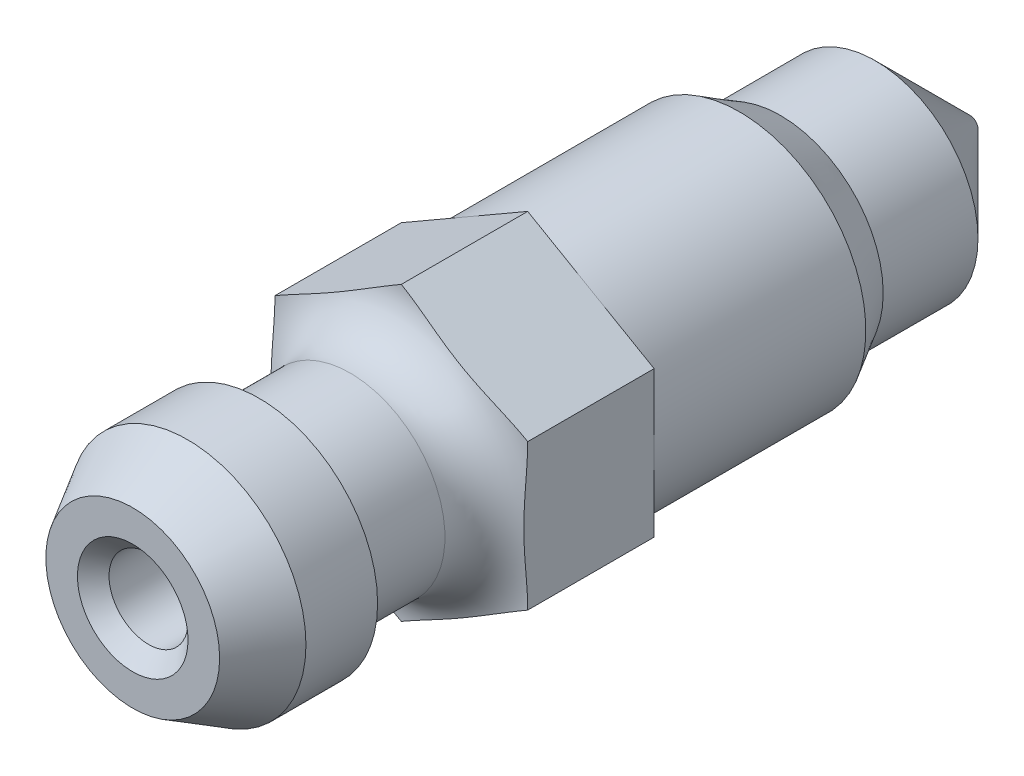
ISO-10303-21;
HEADER;
FILE_DESCRIPTION(('STEP AP214'),'2;1');
FILE_NAME('part.step','',(''),(''),'','','');
FILE_SCHEMA(('AUTOMOTIVE_DESIGN { 1 0 10303 214 1 1 1 1 }'));
ENDSEC;
DATA;
#1=APPLICATION_CONTEXT('core data for automotive mechanical design processes');
#2=APPLICATION_PROTOCOL_DEFINITION('international standard','automotive_design',2000,#1);
#3=PRODUCT_CONTEXT('',#1,'mechanical');
#4=PRODUCT('Part','Part','',(#3));
#5=PRODUCT_RELATED_PRODUCT_CATEGORY('part','',(#4));
#6=PRODUCT_DEFINITION_FORMATION('','',#4);
#7=PRODUCT_DEFINITION_CONTEXT('part definition',#1,'design');
#8=PRODUCT_DEFINITION('design','',#6,#7);
#9=PRODUCT_DEFINITION_SHAPE('','',#8);
#10=(LENGTH_UNIT() NAMED_UNIT(*) SI_UNIT(.MILLI.,.METRE.));
#11=(NAMED_UNIT(*) PLANE_ANGLE_UNIT() SI_UNIT($,.RADIAN.));
#12=(NAMED_UNIT(*) SI_UNIT($,.STERADIAN.) SOLID_ANGLE_UNIT());
#13=UNCERTAINTY_MEASURE_WITH_UNIT(LENGTH_MEASURE(1.E-05),#10,'distance_accuracy_value','');
#14=(GEOMETRIC_REPRESENTATION_CONTEXT(3) GLOBAL_UNCERTAINTY_ASSIGNED_CONTEXT((#13)) GLOBAL_UNIT_ASSIGNED_CONTEXT((#10,
#11,#12)) REPRESENTATION_CONTEXT('',''));
#15=CARTESIAN_POINT('',(0.,0.,0.));
#16=DIRECTION('',(0.,0.,1.));
#17=DIRECTION('',(1.,0.,0.));
#18=AXIS2_PLACEMENT_3D('',#15,#16,#17);
#19=CARTESIAN_POINT('',(-4.00000000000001,2.30940107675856,2.4980018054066E-13));
#20=DIRECTION('',(0.,0.,1.));
#21=DIRECTION('',(1.,0.,0.));
#22=AXIS2_PLACEMENT_3D('',#19,#20,#21);
#23=PLANE('',#22);
#24=CARTESIAN_POINT('',(0.,0.,0.));
#25=DIRECTION('',(0.,0.,-1.));
#26=DIRECTION('',(-1.,0.,0.));
#27=AXIS2_PLACEMENT_3D('',#24,#25,#26);
#28=CIRCLE('',#27,4.);
#29=CARTESIAN_POINT('',(-4.00000000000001,1.08528637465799E-13,2.4980018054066E-13));
#30=VERTEX_POINT('',#29);
#31=CARTESIAN_POINT('',(-2.00000000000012,3.46410161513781,5.82867087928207E-13));
#32=VERTEX_POINT('',#31);
#33=EDGE_CURVE('E256',#30,#32,#28,.T.);
#34=ORIENTED_EDGE('',*,*,#33,.F.);
#35=DIRECTION('',(0.,-1.,0.));
#36=VECTOR('',#35,1.);
#37=CARTESIAN_POINT('',(-4.00000000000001,2.30940107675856,2.4980018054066E-13));
#38=LINE('',#37,#36);
#39=CARTESIAN_POINT('',(-4.00000000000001,2.30940107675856,2.4980018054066E-13));
#40=VERTEX_POINT('',#39);
#41=EDGE_CURVE('E264',#40,#30,#38,.T.);
#42=ORIENTED_EDGE('',*,*,#41,.F.);
#43=DIRECTION('',(-0.866025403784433,-0.499999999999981,0.));
#44=VECTOR('',#43,1.);
#45=CARTESIAN_POINT('',(-1.30104260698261E-13,4.61880215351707,0.));
#46=LINE('',#45,#44);
#47=EDGE_CURVE('E258',#32,#40,#46,.T.);
#48=ORIENTED_EDGE('',*,*,#47,.F.);
#49=EDGE_LOOP('',(#34,#42,#48));
#50=FACE_BOUND('',#49,.T.);
#51=ADVANCED_FACE('F24',(#50),#23,.F.);
#52=CARTESIAN_POINT('',(2.,3.46410161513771,7.21644966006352E-13));
#53=VERTEX_POINT('',#52);
#54=EDGE_CURVE('E255',#32,#53,#28,.T.);
#55=ORIENTED_EDGE('',*,*,#54,.F.);
#56=CARTESIAN_POINT('',(-1.30104260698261E-13,4.61880215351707,0.));
#57=VERTEX_POINT('',#56);
#58=EDGE_CURVE('E260',#57,#32,#46,.T.);
#59=ORIENTED_EDGE('',*,*,#58,.F.);
#60=DIRECTION('',(-0.866025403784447,0.500000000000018,0.));
#61=VECTOR('',#60,1.);
#62=CARTESIAN_POINT('',(-1.30104260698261E-13,4.61880215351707,0.));
#63=LINE('',#62,#61);
#64=EDGE_CURVE('E268',#53,#57,#63,.T.);
#65=ORIENTED_EDGE('',*,*,#64,.F.);
#66=EDGE_LOOP('',(#55,#59,#65));
#67=FACE_BOUND('',#66,.T.);
#68=ADVANCED_FACE('F200',(#67),#23,.F.);
#69=CARTESIAN_POINT('',(4.,0.,0.));
#70=VERTEX_POINT('',#69);
#71=EDGE_CURVE('E254',#53,#70,#28,.T.);
#72=ORIENTED_EDGE('',*,*,#71,.F.);
#73=CARTESIAN_POINT('',(4.,2.30940107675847,2.4980018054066E-13));
#74=VERTEX_POINT('',#73);
#75=EDGE_CURVE('E269',#74,#53,#63,.T.);
#76=ORIENTED_EDGE('',*,*,#75,.F.);
#77=DIRECTION('',(0.,1.,0.));
#78=VECTOR('',#77,1.);
#79=CARTESIAN_POINT('',(4.,2.30940107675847,2.4980018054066E-13));
#80=LINE('',#79,#78);
#81=EDGE_CURVE('E249',#70,#74,#80,.T.);
#82=ORIENTED_EDGE('',*,*,#81,.F.);
#83=EDGE_LOOP('',(#72,#76,#82));
#84=FACE_BOUND('',#83,.T.);
#85=ADVANCED_FACE('F207',(#84),#23,.F.);
#86=CARTESIAN_POINT('',(2.,-3.46410161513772,-7.21644966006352E-13));
#87=VERTEX_POINT('',#86);
#88=EDGE_CURVE('E236',#70,#87,#28,.T.);
#89=ORIENTED_EDGE('',*,*,#88,.F.);
#90=CARTESIAN_POINT('',(4.00000000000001,-2.30940107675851,-1.66533453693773E-13));
#91=VERTEX_POINT('',#90);
#92=EDGE_CURVE('E243',#91,#70,#80,.T.);
#93=ORIENTED_EDGE('',*,*,#92,.F.);
#94=DIRECTION('',(0.866025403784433,0.499999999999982,0.));
#95=VECTOR('',#94,1.);
#96=CARTESIAN_POINT('',(4.00000000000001,-2.30940107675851,-1.66533453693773E-13));
#97=LINE('',#96,#95);
#98=EDGE_CURVE('E240',#87,#91,#97,.T.);
#99=ORIENTED_EDGE('',*,*,#98,.F.);
#100=EDGE_LOOP('',(#89,#93,#99));
#101=FACE_BOUND('',#100,.T.);
#102=ADVANCED_FACE('F219',(#101),#23,.F.);
#103=CARTESIAN_POINT('',(-1.99999999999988,-3.4641016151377,-9.99200722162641E-13));
#104=VERTEX_POINT('',#103);
#105=EDGE_CURVE('E227',#87,#104,#28,.T.);
#106=ORIENTED_EDGE('',*,*,#105,.F.);
#107=CARTESIAN_POINT('',(1.23165366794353E-13,-4.61880215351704,-3.05311331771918E-13));
#108=VERTEX_POINT('',#107);
#109=EDGE_CURVE('E230',#108,#87,#97,.T.);
#110=ORIENTED_EDGE('',*,*,#109,.F.);
#111=DIRECTION('',(0.866025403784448,-0.500000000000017,0.));
#112=VECTOR('',#111,1.);
#113=CARTESIAN_POINT('',(-4.00000000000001,-2.30940107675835,-1.38777878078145E-13));
#114=LINE('',#113,#112);
#115=EDGE_CURVE('E232',#104,#108,#114,.T.);
#116=ORIENTED_EDGE('',*,*,#115,.F.);
#117=EDGE_LOOP('',(#106,#110,#116));
#118=FACE_BOUND('',#117,.T.);
#119=ADVANCED_FACE('F213',(#118),#23,.F.);
#120=EDGE_CURVE('E48',#104,#30,#28,.T.);
#121=ORIENTED_EDGE('',*,*,#120,.F.);
#122=CARTESIAN_POINT('',(-4.00000000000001,-2.30940107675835,-1.38777878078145E-13));
#123=VERTEX_POINT('',#122);
#124=EDGE_CURVE('E244',#123,#104,#114,.T.);
#125=ORIENTED_EDGE('',*,*,#124,.F.);
#126=EDGE_CURVE('E263',#30,#123,#38,.T.);
#127=ORIENTED_EDGE('',*,*,#126,.F.);
#128=EDGE_LOOP('',(#121,#125,#127));
#129=FACE_BOUND('',#128,.T.);
#130=ADVANCED_FACE('F203',(#129),#23,.F.);
#131=CARTESIAN_POINT('',(-1.23165366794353E-13,4.61880215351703,12.4999999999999));
#132=DIRECTION('',(0.500000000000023,-0.866025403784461,0.));
#133=DIRECTION('',(0.866025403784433,0.499999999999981,0.));
#134=AXIS2_PLACEMENT_3D('',#131,#132,#133);
#135=PLANE('',#134);
#136=DIRECTION('',(0.,0.,-1.));
#137=VECTOR('',#136,1.);
#138=CARTESIAN_POINT('',(-4.00000000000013,2.30940107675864,12.5));
#139=LINE('',#138,#137);
#140=CARTESIAN_POINT('',(-4.00000000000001,2.30940107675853,3.9999999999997));
#141=VERTEX_POINT('',#140);
#142=EDGE_CURVE('E281',#141,#40,#139,.T.);
#143=ORIENTED_EDGE('',*,*,#142,.F.);
#144=CARTESIAN_POINT('',(-4.00020000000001,2.30928560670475,4.00000000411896));
#145=CARTESIAN_POINT('',(-3.94166593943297,2.34308026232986,3.99999870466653));
#146=CARTESIAN_POINT('',(-3.88314201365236,2.37686906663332,4.00105349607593));
#147=CARTESIAN_POINT('',(-3.76618299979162,2.44439538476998,4.00486410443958));
#148=CARTESIAN_POINT('',(-3.70774787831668,2.47813291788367,4.00761850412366));
#149=CARTESIAN_POINT('',(-3.5909536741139,2.54556408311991,4.01441759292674));
#150=CARTESIAN_POINT('',(-3.53259457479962,2.57925772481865,4.01846192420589));
#151=CARTESIAN_POINT('',(-3.41589685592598,2.64663318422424,4.02744368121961));
#152=CARTESIAN_POINT('',(-3.35755826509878,2.68031498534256,4.03238159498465));
#153=CARTESIAN_POINT('',(-3.18200268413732,2.78167204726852,4.04798919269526));
#154=CARTESIAN_POINT('',(-3.06483820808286,2.84931698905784,4.05941018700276));
#155=CARTESIAN_POINT('',(-2.83043471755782,2.98464990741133,4.08116713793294));
#156=CARTESIAN_POINT('',(-2.71319570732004,3.05233788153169,4.09150315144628));
#157=CARTESIAN_POINT('',(-2.47867965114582,3.1877357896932,4.10842326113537));
#158=CARTESIAN_POINT('',(-2.36140295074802,3.25544552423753,4.11501319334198));
#159=CARTESIAN_POINT('',(-2.12672579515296,3.39093644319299,4.1227393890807));
#160=CARTESIAN_POINT('',(-2.00932536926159,3.45871761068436,4.12387673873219));
#161=CARTESIAN_POINT('',(-1.77463967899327,3.59421345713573,4.12039723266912));
#162=CARTESIAN_POINT('',(-1.65735438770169,3.6619281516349,4.11578258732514));
#163=CARTESIAN_POINT('',(-1.42296926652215,3.79725046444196,4.1020216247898));
#164=CARTESIAN_POINT('',(-1.30586949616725,3.8648580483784,4.09287406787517));
#165=CARTESIAN_POINT('',(-1.07167336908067,4.00007124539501,4.07238631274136));
#166=CARTESIAN_POINT('',(-0.954577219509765,4.06767673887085,4.06104324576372));
#167=CARTESIAN_POINT('',(-0.720330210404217,4.20291931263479,4.03912672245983));
#168=CARTESIAN_POINT('',(-0.603179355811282,4.2705563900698,4.02855320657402));
#169=CARTESIAN_POINT('',(-0.445447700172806,4.36162280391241,4.01699243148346));
#170=CARTESIAN_POINT('',(-0.404966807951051,4.38499445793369,4.01426206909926));
#171=CARTESIAN_POINT('',(-0.323988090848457,4.43174754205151,4.00940800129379));
#172=CARTESIAN_POINT('',(-0.283490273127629,4.45512896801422,4.0072841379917));
#173=CARTESIAN_POINT('',(-0.202475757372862,4.5019027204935,4.00377723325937));
#174=CARTESIAN_POINT('',(-0.161959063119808,4.52529504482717,4.00239407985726));
#175=CARTESIAN_POINT('',(-0.0808957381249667,4.57209697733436,4.00050459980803));
#176=CARTESIAN_POINT('',(-0.0403491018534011,4.5955065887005,3.99999859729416));
#177=CARTESIAN_POINT('',(0.000199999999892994,4.61891762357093,4.00000000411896));
#178=B_SPLINE_CURVE_WITH_KNOTS('',3,(#144,#145,#146,#147,#148,#149,#150,#151,#152,#153,#154,
#155,#156,#157,#158,#159,#160,#161,#162,#163,#164,#165,#166,#167,#168,#169,#170,#171,#172,#173,
#174,#175,#176,#177),.UNSPECIFIED.,.F.,.F.,(4,2,2,2,2,2,2,2,2,2,2,2,2,2,2,2,4),(0.,
0.202742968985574,0.405317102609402,0.607835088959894,0.810464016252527,1.21777736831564,
1.62506935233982,2.03172506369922,2.43829976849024,2.84471828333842,3.25124801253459,
3.65831256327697,4.06534557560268,4.20581088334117,4.3462395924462,4.48664706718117,
4.62710641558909),.UNSPECIFIED.);
#179=CARTESIAN_POINT('',(-1.30104260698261E-13,4.61880215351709,3.9999999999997));
#180=VERTEX_POINT('',#179);
#181=EDGE_CURVE('E176',#141,#180,#178,.T.);
#182=ORIENTED_EDGE('',*,*,#181,.T.);
#183=DIRECTION('',(0.,0.,-1.));
#184=VECTOR('',#183,1.);
#185=CARTESIAN_POINT('',(-1.23165366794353E-13,4.61880215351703,12.4999999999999));
#186=LINE('',#185,#184);
#187=EDGE_CURVE('E272',#180,#57,#186,.T.);
#188=ORIENTED_EDGE('',*,*,#187,.T.);
#189=ORIENTED_EDGE('',*,*,#58,.T.);
#190=ORIENTED_EDGE('',*,*,#47,.T.);
#191=EDGE_LOOP('',(#143,#182,#188,#189,#190));
#192=FACE_BOUND('',#191,.T.);
#193=ADVANCED_FACE('F26',(#192),#135,.F.);
#194=CARTESIAN_POINT('',(-4.00000000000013,2.30940107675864,12.5));
#195=DIRECTION('',(1.,0.,0.));
#196=DIRECTION('',(0.,0.,-1.));
#197=AXIS2_PLACEMENT_3D('',#194,#195,#196);
#198=PLANE('',#197);
#199=DIRECTION('',(0.,0.,-1.));
#200=VECTOR('',#199,1.);
#201=CARTESIAN_POINT('',(-4.00000000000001,-2.3094010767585,12.5000000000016));
#202=LINE('',#201,#200);
#203=CARTESIAN_POINT('',(-3.99999999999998,-2.30940107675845,4.00000000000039));
#204=VERTEX_POINT('',#203);
#205=EDGE_CURVE('E279',#204,#123,#202,.T.);
#206=ORIENTED_EDGE('',*,*,#205,.F.);
#207=CARTESIAN_POINT('',(-4.00000000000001,1.08528637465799E-13,4.12293975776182));
#208=CARTESIAN_POINT('',(-3.99999999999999,0.135877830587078,4.12293381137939));
#209=CARTESIAN_POINT('',(-4.00000000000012,0.271758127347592,4.12000778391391));
#210=CARTESIAN_POINT('',(-4.00000000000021,0.543319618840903,4.10907325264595));
#211=CARTESIAN_POINT('',(-4.00000000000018,0.679000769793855,4.10106376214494));
#212=CARTESIAN_POINT('',(-4.00000000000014,0.950929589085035,4.08200050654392));
#213=CARTESIAN_POINT('',(-4.00000000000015,1.0871759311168,4.07092921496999));
#214=CARTESIAN_POINT('',(-4.00000000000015,1.35963951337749,4.04865171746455));
#215=CARTESIAN_POINT('',(-4.00000000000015,1.49585675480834,4.03744551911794));
#216=CARTESIAN_POINT('',(-4.00000000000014,1.76670899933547,4.01824317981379));
#217=CARTESIAN_POINT('',(-4.00000000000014,1.90134025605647,4.0102053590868));
#218=CARTESIAN_POINT('',(-4.00000000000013,2.1708067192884,4.00031875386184));
#219=CARTESIAN_POINT('',(-4.00000000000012,2.30564198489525,3.99847238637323));
#220=CARTESIAN_POINT('',(-4.00000000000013,2.70813874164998,4.0071624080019));
#221=CARTESIAN_POINT('',(-4.00000000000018,2.97630136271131,4.03162815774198));
#222=CARTESIAN_POINT('',(-4.00000000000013,3.34663096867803,4.1119146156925));
#223=CARTESIAN_POINT('',(-4.0000000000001,3.45446342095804,4.14115425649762));
#224=CARTESIAN_POINT('',(-4.00000000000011,3.66609840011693,4.21298577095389));
#225=CARTESIAN_POINT('',(-4.00000000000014,3.76988710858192,4.25561956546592));
#226=CARTESIAN_POINT('',(-4.00000000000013,3.97099959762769,4.3564631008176));
#227=CARTESIAN_POINT('',(-4.00000000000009,4.06825229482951,4.41481748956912));
#228=CARTESIAN_POINT('',(-4.0000000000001,4.25067645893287,4.54803952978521));
#229=CARTESIAN_POINT('',(-4.00000000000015,4.33587851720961,4.62286408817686));
#230=CARTESIAN_POINT('',(-4.00000000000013,4.4664284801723,4.76445455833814));
#231=CARTESIAN_POINT('',(-4.00000000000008,4.5161491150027,4.82719370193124));
#232=CARTESIAN_POINT('',(-4.00000000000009,4.6046613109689,4.9600111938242));
#233=CARTESIAN_POINT('',(-4.00000000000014,4.64345793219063,5.03008612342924));
#234=CARTESIAN_POINT('',(-4.00000000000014,4.70822069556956,5.17651099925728));
#235=CARTESIAN_POINT('',(-4.00000000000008,4.73410589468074,5.25289711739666));
#236=CARTESIAN_POINT('',(-4.00000000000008,4.77099782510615,5.40919378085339));
#237=CARTESIAN_POINT('',(-4.00000000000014,4.78201178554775,5.48910259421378));
#238=CARTESIAN_POINT('',(-4.00000000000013,4.78808686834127,5.64129558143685));
#239=CARTESIAN_POINT('',(-4.00000000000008,4.78466580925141,5.71352278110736));
#240=CARTESIAN_POINT('',(-4.00000000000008,4.76545130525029,5.85629339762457));
#241=CARTESIAN_POINT('',(-4.00000000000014,4.74966002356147,5.92683710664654));
#242=CARTESIAN_POINT('',(-4.00000000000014,4.7070271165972,6.06285576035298));
#243=CARTESIAN_POINT('',(-4.00000000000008,4.68042149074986,6.12840549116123));
#244=CARTESIAN_POINT('',(-4.00000000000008,4.6174529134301,6.25460692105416));
#245=CARTESIAN_POINT('',(-4.00000000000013,4.58108807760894,6.31525767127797));
#246=CARTESIAN_POINT('',(-4.00000000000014,4.49647361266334,6.43584253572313));
#247=CARTESIAN_POINT('',(-4.00000000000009,4.44745538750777,6.4952347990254));
#248=CARTESIAN_POINT('',(-4.00000000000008,4.34153753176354,6.60647752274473));
#249=CARTESIAN_POINT('',(-4.00000000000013,4.28463299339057,6.65832324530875));
#250=CARTESIAN_POINT('',(-4.00000000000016,4.13423931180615,6.77872185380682));
#251=CARTESIAN_POINT('',(-4.00000000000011,4.03683799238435,6.84240316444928));
#252=CARTESIAN_POINT('',(-4.00000000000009,3.83310158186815,6.95328329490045));
#253=CARTESIAN_POINT('',(-4.00000000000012,3.72674858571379,7.00044805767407));
#254=CARTESIAN_POINT('',(-4.00000000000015,3.45128084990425,7.10112479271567));
#255=CARTESIAN_POINT('',(-4.00000000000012,3.27863712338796,7.14487468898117));
#256=CARTESIAN_POINT('',(-4.00000000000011,2.92891865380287,7.20609140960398));
#257=CARTESIAN_POINT('',(-4.00000000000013,2.75183414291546,7.22349396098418));
#258=CARTESIAN_POINT('',(-4.00000000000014,2.38100195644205,7.24066135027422));
#259=CARTESIAN_POINT('',(-4.00000000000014,2.18719555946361,7.23868889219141));
#260=CARTESIAN_POINT('',(-4.00000000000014,1.79993737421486,7.22267614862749));
#261=CARTESIAN_POINT('',(-4.00000000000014,1.60648696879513,7.20861283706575));
#262=CARTESIAN_POINT('',(-4.00000000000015,1.31667010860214,7.18552177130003));
#263=CARTESIAN_POINT('',(-4.00000000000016,1.22020911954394,7.17750001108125));
#264=CARTESIAN_POINT('',(-4.00000000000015,1.0272526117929,7.16188957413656));
#265=CARTESIAN_POINT('',(-4.00000000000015,0.930757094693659,7.1543008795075));
#266=CARTESIAN_POINT('',(-4.00000000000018,0.737799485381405,7.14057258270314));
#267=CARTESIAN_POINT('',(-4.00000000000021,0.641337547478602,7.13443089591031));
#268=CARTESIAN_POINT('',(-4.00000000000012,0.448295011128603,7.12439715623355));
#269=CARTESIAN_POINT('',(-4.,0.351714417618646,7.120505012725));
#270=CARTESIAN_POINT('',(-4.00000000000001,0.161527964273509,7.11557463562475));
#271=CARTESIAN_POINT('',(-4.00000000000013,0.0679244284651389,7.11445020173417));
#272=CARTESIAN_POINT('',(-4.00000000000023,-0.119275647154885,7.11494706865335));
#273=CARTESIAN_POINT('',(-4.00000000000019,-0.212872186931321,7.11656838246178));
#274=CARTESIAN_POINT('',(-4.00000000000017,-0.400071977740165,7.12235288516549));
#275=CARTESIAN_POINT('',(-4.00000000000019,-0.493675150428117,7.12651849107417));
#276=CARTESIAN_POINT('',(-4.00000000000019,-0.6807696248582,7.13685987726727));
#277=CARTESIAN_POINT('',(-4.00000000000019,-0.774260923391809,7.14303571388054));
#278=CARTESIAN_POINT('',(-4.00000000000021,-1.05519763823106,7.16350181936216));
#279=CARTESIAN_POINT('',(-4.00000000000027,-1.242490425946,7.17970256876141));
#280=CARTESIAN_POINT('',(-4.00000000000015,-1.61720855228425,7.20936862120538));
#281=CARTESIAN_POINT('',(-3.99999999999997,-1.804633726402,7.22283568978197));
#282=CARTESIAN_POINT('',(-4.00000000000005,-2.17638917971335,7.23827578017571));
#283=CARTESIAN_POINT('',(-4.00000000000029,-2.36070724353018,7.24047114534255));
#284=CARTESIAN_POINT('',(-4.00000000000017,-2.72856725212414,7.22553035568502));
#285=CARTESIAN_POINT('',(-3.9999999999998,-2.91211001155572,7.20843270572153));
#286=CARTESIAN_POINT('',(-3.99999999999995,-3.23370931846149,7.15317346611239));
#287=CARTESIAN_POINT('',(-4.0000000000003,-3.3726859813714,7.12063416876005));
#288=CARTESIAN_POINT('',(-4.00000000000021,-3.64414451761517,7.03448602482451));
#289=CARTESIAN_POINT('',(-3.99999999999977,-3.77663467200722,6.98090487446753));
#290=CARTESIAN_POINT('',(-3.99999999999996,-3.9904268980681,6.86921868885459));
#291=CARTESIAN_POINT('',(-4.0000000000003,-4.07502930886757,6.81746164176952));
#292=CARTESIAN_POINT('',(-4.00000000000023,-4.2350929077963,6.7012991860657));
#293=CARTESIAN_POINT('',(-3.99999999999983,-4.31056616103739,6.63691077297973));
#294=CARTESIAN_POINT('',(-3.99999999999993,-4.43675350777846,6.50783137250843));
#295=CARTESIAN_POINT('',(-4.00000000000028,-4.48949163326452,6.44512740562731));
#296=CARTESIAN_POINT('',(-4.00000000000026,-4.58392668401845,6.31182449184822));
#297=CARTESIAN_POINT('',(-3.99999999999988,-4.62562674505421,6.24122779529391));
#298=CARTESIAN_POINT('',(-3.99999999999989,-4.69592531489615,6.09313321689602));
#299=CARTESIAN_POINT('',(-4.00000000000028,-4.72443337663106,6.0155919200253));
#300=CARTESIAN_POINT('',(-4.00000000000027,-4.76601101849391,5.85646785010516));
#301=CARTESIAN_POINT('',(-3.99999999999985,-4.77909070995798,5.77488776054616));
#302=CARTESIAN_POINT('',(-3.99999999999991,-4.78831274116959,5.62050411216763));
#303=CARTESIAN_POINT('',(-4.00000000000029,-4.78627639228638,5.54780450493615));
#304=CARTESIAN_POINT('',(-4.00000000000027,-4.76963095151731,5.40387690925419));
#305=CARTESIAN_POINT('',(-3.99999999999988,-4.7550245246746,5.33264861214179));
#306=CARTESIAN_POINT('',(-3.99999999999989,-4.71464129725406,5.19564813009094));
#307=CARTESIAN_POINT('',(-4.00000000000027,-4.68918992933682,5.12977886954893));
#308=CARTESIAN_POINT('',(-4.00000000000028,-4.62841859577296,5.00279324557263));
#309=CARTESIAN_POINT('',(-3.99999999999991,-4.5930970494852,4.94167764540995));
#310=CARTESIAN_POINT('',(-3.99999999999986,-4.51072937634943,4.82032039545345));
#311=CARTESIAN_POINT('',(-4.00000000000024,-4.46295000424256,4.76057881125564));
#312=CARTESIAN_POINT('',(-4.0000000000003,-4.35941570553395,4.64849718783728));
#313=CARTESIAN_POINT('',(-3.99999999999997,-4.30365570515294,4.59616189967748));
#314=CARTESIAN_POINT('',(-3.99999999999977,-4.15669812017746,4.47499149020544));
#315=CARTESIAN_POINT('',(-4.00000000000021,-4.06163287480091,4.41083266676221));
#316=CARTESIAN_POINT('',(-4.00000000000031,-3.86244622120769,4.29865347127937));
#317=CARTESIAN_POINT('',(-3.99999999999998,-3.75830674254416,4.25066627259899));
#318=CARTESIAN_POINT('',(-3.99999999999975,-3.48977299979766,4.14823193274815));
#319=CARTESIAN_POINT('',(-4.00000000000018,-3.3218645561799,4.10309062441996));
#320=CARTESIAN_POINT('',(-4.00000000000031,-2.98142559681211,4.03858412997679));
#321=CARTESIAN_POINT('',(-4.00000000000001,-2.80888734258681,4.01926524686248));
#322=CARTESIAN_POINT('',(-3.99999999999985,-2.41695934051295,3.9962820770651));
#323=CARTESIAN_POINT('',(-4.00000000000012,-2.19731338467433,3.99814778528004));
#324=CARTESIAN_POINT('',(-4.00000000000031,-1.75835931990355,4.01702417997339));
#325=CARTESIAN_POINT('',(-4.00000000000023,-1.53905458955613,4.03408372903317));
#326=CARTESIAN_POINT('',(-4.00000000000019,-1.20980341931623,4.06086704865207));
#327=CARTESIAN_POINT('',(-4.0000000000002,-1.09980216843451,4.07001168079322));
#328=CARTESIAN_POINT('',(-4.0000000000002,-0.879701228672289,4.08710763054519));
#329=CARTESIAN_POINT('',(-4.00000000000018,-0.769601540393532,4.09505895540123));
#330=CARTESIAN_POINT('',(-4.0000000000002,-0.549639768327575,4.10837694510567));
#331=CARTESIAN_POINT('',(-4.00000000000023,-0.439778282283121,4.1137529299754));
#332=CARTESIAN_POINT('',(-4.00000000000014,-0.219945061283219,4.12103657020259));
#333=CARTESIAN_POINT('',(-4.00000000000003,-0.109973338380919,4.1229445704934));
#334=CARTESIAN_POINT('',(-4.00000000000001,1.08528637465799E-13,4.12293975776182));
#335=B_SPLINE_CURVE_WITH_KNOTS('',3,(#207,#208,#209,#210,#211,#212,#213,#214,#215,#216,#217,
#218,#219,#220,#221,#222,#223,#224,#225,#226,#227,#228,#229,#230,#231,#232,#233,#234,#235,#236,
#237,#238,#239,#240,#241,#242,#243,#244,#245,#246,#247,#248,#249,#250,#251,#252,#253,#254,#255,
#256,#257,#258,#259,#260,#261,#262,#263,#264,#265,#266,#267,#268,#269,#270,#271,#272,#273,#274,
#275,#276,#277,#278,#279,#280,#281,#282,#283,#284,#285,#286,#287,#288,#289,#290,#291,#292,#293,
#294,#295,#296,#297,#298,#299,#300,#301,#302,#303,#304,#305,#306,#307,#308,#309,#310,#311,#312,
#313,#314,#315,#316,#317,#318,#319,#320,#321,#322,#323,#324,#325,#326,#327,#328,#329,#330,#331,
#332,#333,#334),.UNSPECIFIED.,.T.,.F.,(4,2,2,2,2,2,2,2,2,2,2,2,2,2,2,2,2,2,2,2,2,2,2,2,2,2,2,2,
2,2,2,2,2,2,2,2,2,2,2,2,2,2,2,2,2,2,2,2,2,2,2,2,2,2,2,2,2,2,2,2,2,2,2,4),(0.,0.407612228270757,
0.815303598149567,1.22537879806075,1.63543104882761,2.03989308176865,2.44451298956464,
3.24619153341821,3.58068579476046,3.91623756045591,4.2549889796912,4.59286439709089,
4.83207970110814,5.07118401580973,5.31176903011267,5.55223705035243,5.76808575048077,
5.98389671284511,6.1952313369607,6.4066067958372,6.63675158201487,6.86704023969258,
7.21418289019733,7.56203718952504,8.0932751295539,8.62580692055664,9.20649573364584,
9.78829287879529,10.0786801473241,10.3690554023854,10.6590097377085,10.9489523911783,
11.2297436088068,11.5105361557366,11.7915958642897,12.0726634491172,12.6366458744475,
13.2002628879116,13.7527181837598,14.3040728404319,14.7310404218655,15.1574478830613,
15.4539866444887,15.7501291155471,15.9949394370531,16.2396801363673,16.4860748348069,
16.7323079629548,16.949399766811,17.1664455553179,17.3773921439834,17.5883725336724,
17.8169883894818,18.0457502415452,18.3878803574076,18.7307080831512,19.2493346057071,
19.7688898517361,20.4266256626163,21.0864843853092,21.417629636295,21.7487728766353,
22.0787084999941,22.408611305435),.UNSPECIFIED.);
#336=EDGE_CURVE('E172',#204,#141,#335,.T.);
#337=ORIENTED_EDGE('',*,*,#336,.T.);
#338=ORIENTED_EDGE('',*,*,#142,.T.);
#339=ORIENTED_EDGE('',*,*,#41,.T.);
#340=ORIENTED_EDGE('',*,*,#126,.T.);
#341=EDGE_LOOP('',(#206,#337,#338,#339,#340));
#342=FACE_BOUND('',#341,.T.);
#343=ADVANCED_FACE('F181',(#342),#198,.F.);
#344=CARTESIAN_POINT('',(-4.00000000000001,-2.3094010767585,12.5000000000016));
#345=DIRECTION('',(0.499999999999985,0.866025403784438,0.));
#346=DIRECTION('',(-0.866025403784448,0.500000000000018,0.));
#347=AXIS2_PLACEMENT_3D('',#344,#345,#346);
#348=PLANE('',#347);
#349=DIRECTION('',(0.,0.,-1.));
#350=VECTOR('',#349,1.);
#351=CARTESIAN_POINT('',(1.196959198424E-13,-4.61880215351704,12.5000000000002));
#352=LINE('',#351,#350);
#353=CARTESIAN_POINT('',(1.57859836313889E-13,-4.61880215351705,4.00000000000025));
#354=VERTEX_POINT('',#353);
#355=EDGE_CURVE('E248',#354,#108,#352,.T.);
#356=ORIENTED_EDGE('',*,*,#355,.F.);
#357=CARTESIAN_POINT('',(0.000200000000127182,-4.61891762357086,4.0000000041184));
#358=CARTESIAN_POINT('',(-0.0583340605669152,-4.58512296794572,3.99999870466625));
#359=CARTESIAN_POINT('',(-0.116857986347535,-4.55133416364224,4.00105349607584));
#360=CARTESIAN_POINT('',(-0.233817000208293,-4.48380784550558,4.00486410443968));
#361=CARTESIAN_POINT('',(-0.292252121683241,-4.45007031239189,4.00761850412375));
#362=CARTESIAN_POINT('',(-0.40904632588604,-4.38263914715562,4.01441759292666));
#363=CARTESIAN_POINT('',(-0.467405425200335,-4.34894550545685,4.01846192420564));
#364=CARTESIAN_POINT('',(-0.584103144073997,-4.28157004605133,4.02744368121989));
#365=CARTESIAN_POINT('',(-0.642441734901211,-4.24788824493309,4.03238159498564));
#366=CARTESIAN_POINT('',(-0.817997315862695,-4.14653118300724,4.04798919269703));
#367=CARTESIAN_POINT('',(-0.935161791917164,-4.07888624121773,4.05941018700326));
#368=CARTESIAN_POINT('',(-1.16956528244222,-3.94355332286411,4.08116713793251));
#369=CARTESIAN_POINT('',(-1.28680429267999,-3.87586534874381,4.09150315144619));
#370=CARTESIAN_POINT('',(-1.5213203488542,-3.74046744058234,4.10842326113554));
#371=CARTESIAN_POINT('',(-1.638597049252,-3.672757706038,4.11501319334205));
#372=CARTESIAN_POINT('',(-1.87327420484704,-3.53726678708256,4.1227393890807));
#373=CARTESIAN_POINT('',(-1.9906746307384,-3.4694856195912,4.12387673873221));
#374=CARTESIAN_POINT('',(-2.22536032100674,-3.33398977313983,4.12039723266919));
#375=CARTESIAN_POINT('',(-2.34264561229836,-3.26627507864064,4.11578258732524));
#376=CARTESIAN_POINT('',(-2.57703073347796,-3.13095276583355,4.10202162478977));
#377=CARTESIAN_POINT('',(-2.69413050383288,-3.06334518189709,4.09287406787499));
#378=CARTESIAN_POINT('',(-2.92832663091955,-2.92813198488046,4.07238631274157));
#379=CARTESIAN_POINT('',(-3.04542278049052,-2.86052649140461,4.06104324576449));
#380=CARTESIAN_POINT('',(-3.27966978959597,-2.72528391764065,4.03912672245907));
#381=CARTESIAN_POINT('',(-3.39682064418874,-2.65764684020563,4.02855320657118));
#382=CARTESIAN_POINT('',(-3.55455229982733,-2.56658042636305,4.01699243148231));
#383=CARTESIAN_POINT('',(-3.59503319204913,-2.54320877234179,4.01426206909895));
#384=CARTESIAN_POINT('',(-3.67601190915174,-2.49645568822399,4.00940800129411));
#385=CARTESIAN_POINT('',(-3.71650972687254,-2.47307426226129,4.0072841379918));
#386=CARTESIAN_POINT('',(-3.79752424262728,-2.42630050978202,4.00377723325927));
#387=CARTESIAN_POINT('',(-3.83804093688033,-2.40290818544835,4.00239407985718));
#388=CARTESIAN_POINT('',(-3.91910426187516,-2.35610625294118,4.00050459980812));
#389=CARTESIAN_POINT('',(-3.95965089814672,-2.33269664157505,3.99999859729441));
#390=CARTESIAN_POINT('',(-4.00020000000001,-2.30928560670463,4.0000000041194));
#391=B_SPLINE_CURVE_WITH_KNOTS('',3,(#357,#358,#359,#360,#361,#362,#363,#364,#365,#366,#367,
#368,#369,#370,#371,#372,#373,#374,#375,#376,#377,#378,#379,#380,#381,#382,#383,#384,#385,#386,
#387,#388,#389,#390),.UNSPECIFIED.,.F.,.F.,(4,2,2,2,2,2,2,2,2,2,2,2,2,2,2,2,4),(0.,
0.202742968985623,0.405317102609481,0.607835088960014,0.810464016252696,1.21777736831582,
1.62506935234,2.03172506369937,2.43829976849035,2.84471828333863,3.25124801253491,
3.65831256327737,4.06534557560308,4.20581088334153,4.34623959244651,4.48664706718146,
4.62710641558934),.UNSPECIFIED.);
#392=EDGE_CURVE('E166',#354,#204,#391,.T.);
#393=ORIENTED_EDGE('',*,*,#392,.T.);
#394=ORIENTED_EDGE('',*,*,#205,.T.);
#395=ORIENTED_EDGE('',*,*,#124,.T.);
#396=ORIENTED_EDGE('',*,*,#115,.T.);
#397=EDGE_LOOP('',(#356,#393,#394,#395,#396));
#398=FACE_BOUND('',#397,.T.);
#399=ADVANCED_FACE('F184',(#398),#348,.F.);
#400=CARTESIAN_POINT('',(3.99999999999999,-2.30940107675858,12.5000000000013));
#401=DIRECTION('',(-0.500000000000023,0.866025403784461,0.));
#402=DIRECTION('',(-0.866025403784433,-0.499999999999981,0.));
#403=AXIS2_PLACEMENT_3D('',#400,#401,#402);
#404=PLANE('',#403);
#405=DIRECTION('',(0.,0.,-1.));
#406=VECTOR('',#405,1.);
#407=CARTESIAN_POINT('',(3.99999999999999,-2.30940107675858,12.5000000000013));
#408=LINE('',#407,#406);
#409=CARTESIAN_POINT('',(4.,-2.30940107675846,4.00000000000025));
#410=VERTEX_POINT('',#409);
#411=EDGE_CURVE('E276',#410,#91,#408,.T.);
#412=ORIENTED_EDGE('',*,*,#411,.F.);
#413=CARTESIAN_POINT('',(4.0002,-2.30928560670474,4.0000000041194));
#414=CARTESIAN_POINT('',(3.94166593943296,-2.34308026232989,3.99999870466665));
#415=CARTESIAN_POINT('',(3.88314201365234,-2.37686906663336,4.00105349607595));
#416=CARTESIAN_POINT('',(3.76618299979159,-2.44439538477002,4.00486410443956));
#417=CARTESIAN_POINT('',(3.70774787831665,-2.4781329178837,4.00761850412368));
#418=CARTESIAN_POINT('',(3.59095367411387,-2.54556408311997,4.01441759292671));
#419=CARTESIAN_POINT('',(3.5325945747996,-2.57925772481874,4.01846192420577));
#420=CARTESIAN_POINT('',(3.41589685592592,-2.64663318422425,4.02744368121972));
#421=CARTESIAN_POINT('',(3.35755826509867,-2.68031498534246,4.03238159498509));
#422=CARTESIAN_POINT('',(3.18200268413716,-2.78167204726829,4.04798919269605));
#423=CARTESIAN_POINT('',(3.06483820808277,-2.84931698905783,4.05941018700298));
#424=CARTESIAN_POINT('',(2.83043471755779,-2.98464990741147,4.08116713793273));
#425=CARTESIAN_POINT('',(2.71319570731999,-3.05233788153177,4.09150315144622));
#426=CARTESIAN_POINT('',(2.47867965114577,-3.18773578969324,4.10842326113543));
#427=CARTESIAN_POINT('',(2.36140295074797,-3.25544552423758,4.11501319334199));
#428=CARTESIAN_POINT('',(2.12672579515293,-3.39093644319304,4.12273938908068));
#429=CARTESIAN_POINT('',(2.00932536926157,-3.4587176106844,4.12387673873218));
#430=CARTESIAN_POINT('',(1.77463967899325,-3.59421345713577,4.12039723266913));
#431=CARTESIAN_POINT('',(1.65735438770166,-3.66192815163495,4.11578258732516));
#432=CARTESIAN_POINT('',(1.4229692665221,-3.79725046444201,4.10202162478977));
#433=CARTESIAN_POINT('',(1.3058694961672,-3.86485804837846,4.09287406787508));
#434=CARTESIAN_POINT('',(1.0716733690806,-4.00007124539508,4.07238631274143));
#435=CARTESIAN_POINT('',(0.954577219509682,-4.06767673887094,4.06104324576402));
#436=CARTESIAN_POINT('',(0.720330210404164,-4.20291931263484,4.03912672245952));
#437=CARTESIAN_POINT('',(0.603179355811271,-4.27055639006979,4.02855320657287));
#438=CARTESIAN_POINT('',(0.445447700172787,-4.36162280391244,4.016992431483));
#439=CARTESIAN_POINT('',(0.404966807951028,-4.38499445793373,4.01426206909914));
#440=CARTESIAN_POINT('',(0.32398809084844,-4.43174754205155,4.00940800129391));
#441=CARTESIAN_POINT('',(0.283490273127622,-4.45512896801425,4.00728413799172));
#442=CARTESIAN_POINT('',(0.202475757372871,-4.50190272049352,4.00377723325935));
#443=CARTESIAN_POINT('',(0.161959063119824,-4.5252950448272,4.0023940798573));
#444=CARTESIAN_POINT('',(0.0808957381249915,-4.57209697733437,4.000504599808));
#445=CARTESIAN_POINT('',(0.040349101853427,-4.59550658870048,3.999998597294));
#446=CARTESIAN_POINT('',(-0.000199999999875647,-4.61891762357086,4.0000000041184));
#447=B_SPLINE_CURVE_WITH_KNOTS('',3,(#413,#414,#415,#416,#417,#418,#419,#420,#421,#422,#423,
#424,#425,#426,#427,#428,#429,#430,#431,#432,#433,#434,#435,#436,#437,#438,#439,#440,#441,#442,
#443,#444,#445,#446),.UNSPECIFIED.,.F.,.F.,(4,2,2,2,2,2,2,2,2,2,2,2,2,2,2,2,4),(0.,
0.202742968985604,0.405317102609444,0.607835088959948,0.810464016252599,1.21777736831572,
1.62506935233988,2.03172506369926,2.43829976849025,2.84471828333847,3.25124801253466,
3.65831256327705,4.06534557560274,4.20581088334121,4.34623959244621,4.48664706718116,
4.62710641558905),.UNSPECIFIED.);
#448=EDGE_CURVE('E134',#410,#354,#447,.T.);
#449=ORIENTED_EDGE('',*,*,#448,.T.);
#450=ORIENTED_EDGE('',*,*,#355,.T.);
#451=ORIENTED_EDGE('',*,*,#109,.T.);
#452=ORIENTED_EDGE('',*,*,#98,.T.);
#453=EDGE_LOOP('',(#412,#449,#450,#451,#452));
#454=FACE_BOUND('',#453,.T.);
#455=ADVANCED_FACE('F188',(#454),#404,.F.);
#456=CARTESIAN_POINT('',(3.99999999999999,2.3094010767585,12.4999999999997));
#457=DIRECTION('',(-1.,0.,0.));
#458=DIRECTION('',(0.,0.,1.));
#459=AXIS2_PLACEMENT_3D('',#456,#457,#458);
#460=PLANE('',#459);
#461=DIRECTION('',(0.,0.,-1.));
#462=VECTOR('',#461,1.);
#463=CARTESIAN_POINT('',(3.99999999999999,2.3094010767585,12.4999999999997));
#464=LINE('',#463,#462);
#465=CARTESIAN_POINT('',(4.00000000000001,2.30940107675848,3.9999999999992));
#466=VERTEX_POINT('',#465);
#467=EDGE_CURVE('E274',#466,#74,#464,.T.);
#468=ORIENTED_EDGE('',*,*,#467,.F.);
#469=CARTESIAN_POINT('',(4.,0.,4.12293975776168));
#470=CARTESIAN_POINT('',(4.,-0.135877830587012,4.12293381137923));
#471=CARTESIAN_POINT('',(3.99999999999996,-0.271758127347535,4.12000778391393));
#472=CARTESIAN_POINT('',(3.99999999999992,-0.543319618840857,4.1090732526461));
#473=CARTESIAN_POINT('',(3.99999999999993,-0.679000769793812,4.10106376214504));
#474=CARTESIAN_POINT('',(3.99999999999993,-0.950929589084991,4.08200050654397));
#475=CARTESIAN_POINT('',(3.99999999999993,-1.08717593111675,4.07092921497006));
#476=CARTESIAN_POINT('',(3.99999999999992,-1.35963951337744,4.04865171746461));
#477=CARTESIAN_POINT('',(3.99999999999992,-1.49585675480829,4.03744551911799));
#478=CARTESIAN_POINT('',(3.99999999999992,-1.7667089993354,4.01824317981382));
#479=CARTESIAN_POINT('',(3.99999999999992,-1.90134025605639,4.01020535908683));
#480=CARTESIAN_POINT('',(3.9999999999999,-2.17080671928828,4.00031875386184));
#481=CARTESIAN_POINT('',(3.99999999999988,-2.30564198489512,3.99847238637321));
#482=CARTESIAN_POINT('',(3.99999999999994,-2.70813874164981,4.0071624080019));
#483=CARTESIAN_POINT('',(4.00000000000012,-2.9763013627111,4.0316281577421));
#484=CARTESIAN_POINT('',(3.99999999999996,-3.34663096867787,4.11191461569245));
#485=CARTESIAN_POINT('',(3.99999999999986,-3.45446342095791,4.14115425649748));
#486=CARTESIAN_POINT('',(3.99999999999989,-3.66609840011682,4.21298577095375));
#487=CARTESIAN_POINT('',(4.00000000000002,-3.76988710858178,4.2556195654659));
#488=CARTESIAN_POINT('',(4.,-3.97099959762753,4.35646310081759));
#489=CARTESIAN_POINT('',(3.99999999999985,-4.06825229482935,4.41481748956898));
#490=CARTESIAN_POINT('',(3.99999999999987,-4.25067645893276,4.54803952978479));
#491=CARTESIAN_POINT('',(4.00000000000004,-4.33587851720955,4.62286408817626));
#492=CARTESIAN_POINT('',(3.99999999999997,-4.46642848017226,4.7644545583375));
#493=CARTESIAN_POINT('',(3.99999999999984,-4.51614911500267,4.82719370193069));
#494=CARTESIAN_POINT('',(3.99999999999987,-4.60466131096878,4.96001119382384));
#495=CARTESIAN_POINT('',(4.00000000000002,-4.64345793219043,5.03008612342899));
#496=CARTESIAN_POINT('',(4.00000000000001,-4.70822069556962,5.17651099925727));
#497=CARTESIAN_POINT('',(3.99999999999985,-4.7341058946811,5.2528971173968));
#498=CARTESIAN_POINT('',(3.99999999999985,-4.77099782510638,5.4091937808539));
#499=CARTESIAN_POINT('',(4.00000000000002,-4.78201178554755,5.4891025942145));
#500=CARTESIAN_POINT('',(4.,-4.78808686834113,5.64129558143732));
#501=CARTESIAN_POINT('',(3.99999999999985,-4.78466580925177,5.71352278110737));
#502=CARTESIAN_POINT('',(3.99999999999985,-4.76545130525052,5.85629339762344));
#503=CARTESIAN_POINT('',(4.00000000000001,-4.74966002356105,5.92683710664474));
#504=CARTESIAN_POINT('',(4.00000000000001,-4.70702711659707,6.06285576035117));
#505=CARTESIAN_POINT('',(3.99999999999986,-4.6804214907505,6.12840549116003));
#506=CARTESIAN_POINT('',(3.99999999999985,-4.61745291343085,6.25460692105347));
#507=CARTESIAN_POINT('',(4.,-4.58108807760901,6.31525767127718));
#508=CARTESIAN_POINT('',(4.00000000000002,-4.49647361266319,6.43584253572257));
#509=CARTESIAN_POINT('',(3.99999999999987,-4.4474553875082,6.49523479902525));
#510=CARTESIAN_POINT('',(3.99999999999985,-4.34153753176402,6.6064775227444));
#511=CARTESIAN_POINT('',(3.99999999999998,-4.28463299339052,6.65832324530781));
#512=CARTESIAN_POINT('',(4.00000000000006,-4.1342393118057,6.77872185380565));
#513=CARTESIAN_POINT('',(3.99999999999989,-4.03683799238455,6.84240316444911));
#514=CARTESIAN_POINT('',(3.99999999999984,-3.83310158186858,6.95328329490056));
#515=CARTESIAN_POINT('',(3.99999999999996,-3.72674858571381,7.00044805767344));
#516=CARTESIAN_POINT('',(4.00000000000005,-3.45128084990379,7.10112479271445));
#517=CARTESIAN_POINT('',(3.9999999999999,-3.27863712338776,7.14487468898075));
#518=CARTESIAN_POINT('',(3.99999999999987,-2.92891865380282,7.20609140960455));
#519=CARTESIAN_POINT('',(3.99999999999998,-2.7518341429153,7.22349396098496));
#520=CARTESIAN_POINT('',(4.00000000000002,-2.38100195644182,7.24066135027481));
#521=CARTESIAN_POINT('',(3.99999999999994,-2.18719555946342,7.23868889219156));
#522=CARTESIAN_POINT('',(3.99999999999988,-1.79993737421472,7.22267614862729));
#523=CARTESIAN_POINT('',(3.99999999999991,-1.60648696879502,7.20861283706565));
#524=CARTESIAN_POINT('',(3.99999999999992,-1.31667010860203,7.18552177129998));
#525=CARTESIAN_POINT('',(3.99999999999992,-1.22020911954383,7.1775000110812));
#526=CARTESIAN_POINT('',(3.99999999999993,-1.02725261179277,7.16188957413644));
#527=CARTESIAN_POINT('',(3.99999999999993,-0.930757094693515,7.1543008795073));
#528=CARTESIAN_POINT('',(3.99999999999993,-0.737799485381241,7.14057258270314));
#529=CARTESIAN_POINT('',(3.99999999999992,-0.641337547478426,7.13443089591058));
#530=CARTESIAN_POINT('',(3.99999999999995,-0.448295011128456,7.12439715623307));
#531=CARTESIAN_POINT('',(4.,-0.351714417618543,7.12050501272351));
#532=CARTESIAN_POINT('',(4.,-0.161527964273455,7.1155746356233));
#533=CARTESIAN_POINT('',(3.99999999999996,-0.067924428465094,7.11445020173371));
#534=CARTESIAN_POINT('',(3.99999999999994,0.119275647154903,7.11494706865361));
#535=CARTESIAN_POINT('',(3.99999999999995,0.212872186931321,7.11656838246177));
#536=CARTESIAN_POINT('',(3.99999999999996,0.400071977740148,7.1223528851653));
#537=CARTESIAN_POINT('',(3.99999999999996,0.4936751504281,7.12651849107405));
#538=CARTESIAN_POINT('',(3.99999999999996,0.680769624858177,7.1368598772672));
#539=CARTESIAN_POINT('',(3.99999999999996,0.77426092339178,7.14303571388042));
#540=CARTESIAN_POINT('',(3.99999999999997,1.05519763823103,7.16350181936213));
#541=CARTESIAN_POINT('',(3.99999999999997,1.24249042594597,7.1797025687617));
#542=CARTESIAN_POINT('',(3.99999999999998,1.61720855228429,7.20936862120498));
#543=CARTESIAN_POINT('',(3.99999999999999,1.80463372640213,7.22283568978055));
#544=CARTESIAN_POINT('',(4.00000000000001,2.17638917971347,7.23827578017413));
#545=CARTESIAN_POINT('',(4.,2.3607072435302,7.2404711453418));
#546=CARTESIAN_POINT('',(4.,2.72856725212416,7.22553035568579));
#547=CARTESIAN_POINT('',(3.99999999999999,2.91211001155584,7.20843270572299));
#548=CARTESIAN_POINT('',(4.00000000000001,3.23370931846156,7.15317346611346));
#549=CARTESIAN_POINT('',(4.00000000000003,3.3726859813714,7.12063416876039));
#550=CARTESIAN_POINT('',(4.00000000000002,3.64414451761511,7.03448602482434));
#551=CARTESIAN_POINT('',(3.99999999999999,3.77663467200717,6.9809048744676));
#552=CARTESIAN_POINT('',(4.00000000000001,3.99042689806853,6.86921868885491));
#553=CARTESIAN_POINT('',(4.00000000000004,4.07502930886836,6.81746164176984));
#554=CARTESIAN_POINT('',(4.00000000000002,4.23509290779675,6.70129918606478));
#555=CARTESIAN_POINT('',(3.99999999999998,4.31056616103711,6.63691077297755));
#556=CARTESIAN_POINT('',(3.99999999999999,4.43675350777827,6.5078313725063));
#557=CARTESIAN_POINT('',(4.00000000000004,4.48949163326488,6.44512740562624));
#558=CARTESIAN_POINT('',(4.00000000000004,4.58392668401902,6.31182449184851));
#559=CARTESIAN_POINT('',(3.99999999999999,4.62562674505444,6.24122779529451));
#560=CARTESIAN_POINT('',(3.99999999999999,4.69592531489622,6.09313321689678));
#561=CARTESIAN_POINT('',(4.00000000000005,4.72443337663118,6.01559192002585));
#562=CARTESIAN_POINT('',(4.00000000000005,4.76601101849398,5.85646785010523));
#563=CARTESIAN_POINT('',(4.,4.77909070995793,5.77488776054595));
#564=CARTESIAN_POINT('',(4.,4.78831274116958,5.62050411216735));
#565=CARTESIAN_POINT('',(4.00000000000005,4.78627639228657,5.5478045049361));
#566=CARTESIAN_POINT('',(4.00000000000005,4.76963095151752,5.40387690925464));
#567=CARTESIAN_POINT('',(3.99999999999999,4.75502452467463,5.3326486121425));
#568=CARTESIAN_POINT('',(3.99999999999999,4.71464129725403,5.19564813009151));
#569=CARTESIAN_POINT('',(4.00000000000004,4.68918992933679,5.12977886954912));
#570=CARTESIAN_POINT('',(4.00000000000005,4.62841859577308,5.00279324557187));
#571=CARTESIAN_POINT('',(4.,4.59309704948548,4.94167764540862));
#572=CARTESIAN_POINT('',(3.99999999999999,4.51072937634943,4.82032039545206));
#573=CARTESIAN_POINT('',(4.00000000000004,4.4629500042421,4.76057881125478));
#574=CARTESIAN_POINT('',(4.00000000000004,4.35941570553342,4.64849718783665));
#575=CARTESIAN_POINT('',(4.,4.30365570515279,4.59616189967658));
#576=CARTESIAN_POINT('',(3.99999999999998,4.15669812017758,4.47499149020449));
#577=CARTESIAN_POINT('',(4.00000000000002,4.0616328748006,4.41083266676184));
#578=CARTESIAN_POINT('',(4.00000000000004,3.86244622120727,4.29865347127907));
#579=CARTESIAN_POINT('',(4.00000000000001,3.75830674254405,4.25066627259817));
#580=CARTESIAN_POINT('',(3.99999999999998,3.4897729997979,4.14823193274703));
#581=CARTESIAN_POINT('',(4.00000000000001,3.32186455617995,4.1030906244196));
#582=CARTESIAN_POINT('',(4.00000000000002,2.98142559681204,4.03858412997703));
#583=CARTESIAN_POINT('',(4.00000000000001,2.80888734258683,4.01926524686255));
#584=CARTESIAN_POINT('',(3.99999999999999,2.41695934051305,3.99628207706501));
#585=CARTESIAN_POINT('',(3.99999999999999,2.1973133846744,3.99814778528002));
#586=CARTESIAN_POINT('',(3.99999999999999,1.75835931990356,4.01702417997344));
#587=CARTESIAN_POINT('',(3.99999999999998,1.53905458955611,4.03408372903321));
#588=CARTESIAN_POINT('',(3.99999999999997,1.20980341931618,4.06086704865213));
#589=CARTESIAN_POINT('',(3.99999999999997,1.09980216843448,4.07001168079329));
#590=CARTESIAN_POINT('',(3.99999999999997,0.879701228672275,4.08710763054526));
#591=CARTESIAN_POINT('',(3.99999999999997,0.769601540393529,4.09505895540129));
#592=CARTESIAN_POINT('',(3.99999999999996,0.549639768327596,4.10837694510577));
#593=CARTESIAN_POINT('',(3.99999999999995,0.439778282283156,4.11375292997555));
#594=CARTESIAN_POINT('',(3.99999999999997,0.219945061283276,4.12103657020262));
#595=CARTESIAN_POINT('',(4.,0.109973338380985,4.12294457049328));
#596=CARTESIAN_POINT('',(4.,0.,4.12293975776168));
#597=B_SPLINE_CURVE_WITH_KNOTS('',3,(#469,#470,#471,#472,#473,#474,#475,#476,#477,#478,#479,
#480,#481,#482,#483,#484,#485,#486,#487,#488,#489,#490,#491,#492,#493,#494,#495,#496,#497,#498,
#499,#500,#501,#502,#503,#504,#505,#506,#507,#508,#509,#510,#511,#512,#513,#514,#515,#516,#517,
#518,#519,#520,#521,#522,#523,#524,#525,#526,#527,#528,#529,#530,#531,#532,#533,#534,#535,#536,
#537,#538,#539,#540,#541,#542,#543,#544,#545,#546,#547,#548,#549,#550,#551,#552,#553,#554,#555,
#556,#557,#558,#559,#560,#561,#562,#563,#564,#565,#566,#567,#568,#569,#570,#571,#572,#573,#574,
#575,#576,#577,#578,#579,#580,#581,#582,#583,#584,#585,#586,#587,#588,#589,#590,#591,#592,#593,
#594,#595,#596),.UNSPECIFIED.,.T.,.F.,(4,2,2,2,2,2,2,2,2,2,2,2,2,2,2,2,2,2,2,2,2,2,2,2,2,2,2,2,
2,2,2,2,2,2,2,2,2,2,2,2,2,2,2,2,2,2,2,2,2,2,2,2,2,2,2,2,2,2,2,2,2,2,2,4),(0.,0.407612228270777,
0.815303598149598,1.22537879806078,1.63543104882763,2.03989308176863,2.44451298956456,
3.24619153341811,3.58068579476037,3.91623756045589,4.25498897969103,4.59286439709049,
4.83207970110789,5.07118401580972,5.31176903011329,5.55223705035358,5.76808575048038,
5.98389671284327,6.19523133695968,6.40660679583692,6.63675158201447,6.86704023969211,
7.21418289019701,7.56203718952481,8.09327512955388,8.62580692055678,9.20649573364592,
9.7882928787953,10.0786801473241,10.3690554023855,10.6590097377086,10.9489523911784,
11.2297436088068,11.5105361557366,11.7915958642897,12.0726634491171,12.6366458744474,
13.2002628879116,13.7527181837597,14.3040728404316,14.7310404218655,15.1574478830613,
15.4539866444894,15.7501291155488,15.9949394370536,16.2396801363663,16.4860748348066,
16.7323079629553,16.9493997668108,17.1664455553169,17.3773921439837,17.5883725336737,
17.8169883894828,18.045750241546,18.3878803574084,18.7307080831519,19.2493346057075,
19.7688898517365,20.4266256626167,21.0864843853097,21.4176296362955,21.7487728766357,
22.0787084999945,22.4086113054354),.UNSPECIFIED.);
#598=EDGE_CURVE('E40',#466,#410,#597,.T.);
#599=ORIENTED_EDGE('',*,*,#598,.T.);
#600=ORIENTED_EDGE('',*,*,#411,.T.);
#601=ORIENTED_EDGE('',*,*,#92,.T.);
#602=ORIENTED_EDGE('',*,*,#81,.T.);
#603=EDGE_LOOP('',(#468,#599,#600,#601,#602));
#604=FACE_BOUND('',#603,.T.);
#605=ADVANCED_FACE('F140',(#604),#460,.F.);
#606=CARTESIAN_POINT('',(-1.23165366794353E-13,4.61880215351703,12.4999999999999));
#607=DIRECTION('',(-0.499999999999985,-0.866025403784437,0.));
#608=DIRECTION('',(0.866025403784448,-0.500000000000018,0.));
#609=AXIS2_PLACEMENT_3D('',#606,#607,#608);
#610=PLANE('',#609);
#611=ORIENTED_EDGE('',*,*,#187,.F.);
#612=CARTESIAN_POINT('',(-0.000200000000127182,4.61891762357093,4.00000000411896));
#613=CARTESIAN_POINT('',(0.0583340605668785,4.58512296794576,3.99999870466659));
#614=CARTESIAN_POINT('',(0.116857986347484,4.55133416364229,4.00105349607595));
#615=CARTESIAN_POINT('',(0.233817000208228,4.48380784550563,4.00486410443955));
#616=CARTESIAN_POINT('',(0.292252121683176,4.45007031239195,4.00761850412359));
#617=CARTESIAN_POINT('',(0.409046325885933,4.38263914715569,4.0144175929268));
#618=CARTESIAN_POINT('',(0.467405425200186,4.34894550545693,4.0184619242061));
#619=CARTESIAN_POINT('',(0.58410314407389,4.28157004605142,4.02744368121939));
#620=CARTESIAN_POINT('',(0.642441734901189,4.24788824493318,4.03238159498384));
#621=CARTESIAN_POINT('',(0.817997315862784,4.14653118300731,4.0479891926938));
#622=CARTESIAN_POINT('',(0.935161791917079,4.07888624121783,4.05941018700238));
#623=CARTESIAN_POINT('',(1.16956528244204,3.9435533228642,4.08116713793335));
#624=CARTESIAN_POINT('',(1.28680429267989,3.87586534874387,4.0915031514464));
#625=CARTESIAN_POINT('',(1.52132034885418,3.74046744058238,4.1084232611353));
#626=CARTESIAN_POINT('',(1.63859704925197,3.67275770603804,4.11501319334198));
#627=CARTESIAN_POINT('',(1.87327420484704,3.53726678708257,4.12273938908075));
#628=CARTESIAN_POINT('',(1.99067463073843,3.4694856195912,4.12387673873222));
#629=CARTESIAN_POINT('',(2.22536032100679,3.33398977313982,4.12039723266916));
#630=CARTESIAN_POINT('',(2.34264561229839,3.26627507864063,4.11578258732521));
#631=CARTESIAN_POINT('',(2.57703073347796,3.13095276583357,4.10202162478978));
#632=CARTESIAN_POINT('',(2.69413050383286,3.06334518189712,4.09287406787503));
#633=CARTESIAN_POINT('',(2.92832663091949,2.92813198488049,4.07238631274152));
#634=CARTESIAN_POINT('',(3.04542278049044,2.86052649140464,4.06104324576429));
#635=CARTESIAN_POINT('',(3.27966978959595,2.72528391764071,4.03912672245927));
#636=CARTESIAN_POINT('',(3.39682064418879,2.65764684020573,4.02855320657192));
#637=CARTESIAN_POINT('',(3.55455229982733,2.5665804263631,4.01699243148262));
#638=CARTESIAN_POINT('',(3.59503319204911,2.54320877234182,4.01426206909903));
#639=CARTESIAN_POINT('',(3.67601190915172,2.49645568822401,4.00940800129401));
#640=CARTESIAN_POINT('',(3.71650972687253,2.4730742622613,4.00728413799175));
#641=CARTESIAN_POINT('',(3.79752424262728,2.42630050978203,4.00377723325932));
#642=CARTESIAN_POINT('',(3.83804093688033,2.40290818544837,4.00239407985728));
#643=CARTESIAN_POINT('',(3.91910426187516,2.35610625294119,4.00050459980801));
#644=CARTESIAN_POINT('',(3.95965089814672,2.33269664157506,3.99999859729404));
#645=CARTESIAN_POINT('',(4.00020000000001,2.30928560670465,4.00000000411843));
#646=B_SPLINE_CURVE_WITH_KNOTS('',3,(#612,#613,#614,#615,#616,#617,#618,#619,#620,#621,#622,
#623,#624,#625,#626,#627,#628,#629,#630,#631,#632,#633,#634,#635,#636,#637,#638,#639,#640,#641,
#642,#643,#644,#645),.UNSPECIFIED.,.F.,.F.,(4,2,2,2,2,2,2,2,2,2,2,2,2,2,2,2,4),(0.,
0.202742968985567,0.405317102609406,0.607835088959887,0.810464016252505,1.2177773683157,
1.62506935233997,2.03172506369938,2.43829976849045,2.84471828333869,3.25124801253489,
3.65831256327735,4.06534557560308,4.20581088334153,4.34623959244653,4.48664706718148,
4.62710641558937),.UNSPECIFIED.);
#647=EDGE_CURVE('E156',#180,#466,#646,.T.);
#648=ORIENTED_EDGE('',*,*,#647,.T.);
#649=ORIENTED_EDGE('',*,*,#467,.T.);
#650=ORIENTED_EDGE('',*,*,#75,.T.);
#651=ORIENTED_EDGE('',*,*,#64,.T.);
#652=EDGE_LOOP('',(#611,#648,#649,#650,#651));
#653=FACE_BOUND('',#652,.T.);
#654=ADVANCED_FACE('F196',(#653),#610,.F.);
#655=CARTESIAN_POINT('',(0.,0.,-8.0000000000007));
#656=DIRECTION('',(0.,0.,1.));
#657=DIRECTION('',(1.,0.,0.));
#658=AXIS2_PLACEMENT_3D('',#655,#656,#657);
#659=CYLINDRICAL_SURFACE('',#658,4.);
#660=CARTESIAN_POINT('',(0.,0.,-6.70096189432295));
#661=DIRECTION('',(0.,0.,-1.));
#662=DIRECTION('',(-1.,0.,0.));
#663=AXIS2_PLACEMENT_3D('',#660,#661,#662);
#664=CIRCLE('',#663,4.);
#665=CARTESIAN_POINT('',(-4.00000000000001,0.,-6.70096189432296));
#666=VERTEX_POINT('',#665);
#667=EDGE_CURVE('E288',#666,#666,#664,.F.);
#668=ORIENTED_EDGE('',*,*,#667,.T.);
#669=EDGE_LOOP('',(#668));
#670=FACE_BOUND('',#669,.T.);
#671=ORIENTED_EDGE('',*,*,#33,.T.);
#672=ORIENTED_EDGE('',*,*,#54,.T.);
#673=ORIENTED_EDGE('',*,*,#71,.T.);
#674=ORIENTED_EDGE('',*,*,#88,.T.);
#675=ORIENTED_EDGE('',*,*,#105,.T.);
#676=ORIENTED_EDGE('',*,*,#120,.T.);
#677=EDGE_LOOP('',(#671,#672,#673,#674,#675,#676));
#678=FACE_BOUND('',#677,.T.);
#679=ADVANCED_FACE('F252',(#670,#678),#659,.T.);
#680=CARTESIAN_POINT('',(-1.26634813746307E-13,0.,-13.9999999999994));
#681=DIRECTION('',(0.,0.,1.));
#682=DIRECTION('',(1.,0.,0.));
#683=AXIS2_PLACEMENT_3D('',#680,#681,#682);
#684=CYLINDRICAL_SURFACE('',#683,3.25);
#685=CARTESIAN_POINT('',(-0.749999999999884,-3.16227766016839,-9.99999999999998));
#686=CARTESIAN_POINT('',(-0.74999865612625,-3.16227849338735,-10.0415214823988));
#687=CARTESIAN_POINT('',(-0.746540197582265,-3.16310435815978,-10.0830586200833));
#688=CARTESIAN_POINT('',(-0.732815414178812,-3.16631164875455,-10.164947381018));
#689=CARTESIAN_POINT('',(-0.7225445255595,-3.1686941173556,-10.2052981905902));
#690=CARTESIAN_POINT('',(-0.69553904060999,-3.17473074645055,-10.283617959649));
#691=CARTESIAN_POINT('',(-0.678811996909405,-3.17838342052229,-10.3215896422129));
#692=CARTESIAN_POINT('',(-0.63939119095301,-3.18654708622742,-10.3941899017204));
#693=CARTESIAN_POINT('',(-0.616697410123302,-3.19105808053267,-10.4288184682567));
#694=CARTESIAN_POINT('',(-0.565532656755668,-3.20052483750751,-10.4944001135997));
#695=CARTESIAN_POINT('',(-0.536970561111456,-3.20548682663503,-10.5252812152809));
#696=CARTESIAN_POINT('',(-0.475076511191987,-3.21524216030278,-10.5818595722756));
#697=CARTESIAN_POINT('',(-0.441744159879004,-3.2200354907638,-10.607556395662));
#698=CARTESIAN_POINT('',(-0.370769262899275,-3.22898164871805,-10.6533251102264));
#699=CARTESIAN_POINT('',(-0.333080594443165,-3.23312627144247,-10.6733272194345));
#700=CARTESIAN_POINT('',(-0.254764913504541,-3.2402374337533,-10.7066864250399));
#701=CARTESIAN_POINT('',(-0.214138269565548,-3.24320412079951,-10.7200443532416));
#702=CARTESIAN_POINT('',(-0.131849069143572,-3.2475811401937,-10.7395080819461));
#703=CARTESIAN_POINT('',(-0.0902167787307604,-3.24901761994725,-10.745735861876));
#704=CARTESIAN_POINT('',(-0.00647521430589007,-3.25026316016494,-10.7511444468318));
#705=CARTESIAN_POINT('',(0.0356339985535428,-3.25007242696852,-10.7503261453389));
#706=CARTESIAN_POINT('',(0.118291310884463,-3.2481048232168,-10.7417554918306));
#707=CARTESIAN_POINT('',(0.158853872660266,-3.24635804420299,-10.7341346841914));
#708=CARTESIAN_POINT('',(0.238108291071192,-3.24150917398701,-10.7123856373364));
#709=CARTESIAN_POINT('',(0.276800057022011,-3.23840701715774,-10.6982570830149));
#710=CARTESIAN_POINT('',(0.351572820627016,-3.23114842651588,-10.6637809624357));
#711=CARTESIAN_POINT('',(0.387630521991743,-3.22698377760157,-10.6433846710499));
#712=CARTESIAN_POINT('',(0.455858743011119,-3.21805507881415,-10.5969886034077));
#713=CARTESIAN_POINT('',(0.488028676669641,-3.21329093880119,-10.5709879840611));
#714=CARTESIAN_POINT('',(0.54835147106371,-3.20355538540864,-10.5134091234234));
#715=CARTESIAN_POINT('',(0.576394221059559,-3.19858172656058,-10.4817157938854));
#716=CARTESIAN_POINT('',(0.62678886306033,-3.18909002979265,-10.4140243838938));
#717=CARTESIAN_POINT('',(0.649140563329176,-3.18457200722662,-10.3780261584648));
#718=CARTESIAN_POINT('',(0.687575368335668,-3.17649634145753,-10.3025548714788));
#719=CARTESIAN_POINT('',(0.703635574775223,-3.17294222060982,-10.2630697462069));
#720=CARTESIAN_POINT('',(0.728858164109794,-3.16724402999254,-10.1818591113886));
#721=CARTESIAN_POINT('',(0.738021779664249,-3.16509970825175,-10.1401340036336));
#722=CARTESIAN_POINT('',(0.749015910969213,-3.16251587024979,-10.0566395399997));
#723=CARTESIAN_POINT('',(0.751007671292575,-3.16203887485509,-10.0148925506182));
#724=CARTESIAN_POINT('',(0.748039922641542,-3.16274225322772,-9.93166298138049));
#725=CARTESIAN_POINT('',(0.743080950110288,-3.16392249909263,-9.89018038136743));
#726=CARTESIAN_POINT('',(0.726492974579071,-3.16777178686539,-9.80923222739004));
#727=CARTESIAN_POINT('',(0.714954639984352,-3.17042057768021,-9.76974704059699));
#728=CARTESIAN_POINT('',(0.685634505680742,-3.17688988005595,-9.69327060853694));
#729=CARTESIAN_POINT('',(0.667852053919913,-3.18071051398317,-9.6562796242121));
#730=CARTESIAN_POINT('',(0.626199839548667,-3.18917408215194,-9.58514923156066));
#731=CARTESIAN_POINT('',(0.602231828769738,-3.19382987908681,-9.55106891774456));
#732=CARTESIAN_POINT('',(0.54901579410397,-3.20340615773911,-9.4873548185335));
#733=CARTESIAN_POINT('',(0.519767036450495,-3.20832667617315,-9.45772165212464));
#734=CARTESIAN_POINT('',(0.456086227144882,-3.21800281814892,-9.40310709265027));
#735=CARTESIAN_POINT('',(0.421558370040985,-3.22275282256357,-9.37823623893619));
#736=CARTESIAN_POINT('',(0.348721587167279,-3.2314449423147,-9.33464729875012));
#737=CARTESIAN_POINT('',(0.310412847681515,-3.23538709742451,-9.31592890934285));
#738=CARTESIAN_POINT('',(0.231352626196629,-3.24199588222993,-9.28532513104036));
#739=CARTESIAN_POINT('',(0.190619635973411,-3.24467104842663,-9.27339389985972));
#740=CARTESIAN_POINT('',(0.107658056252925,-3.24848153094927,-9.25656174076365));
#741=CARTESIAN_POINT('',(0.0654297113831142,-3.24961709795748,-9.25165966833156));
#742=CARTESIAN_POINT('',(-0.0182786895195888,-3.25021195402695,-9.24908127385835));
#743=CARTESIAN_POINT('',(-0.0597534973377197,-3.24970935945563,-9.25124065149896));
#744=CARTESIAN_POINT('',(-0.141732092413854,-3.24716708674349,-9.26235309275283));
#745=CARTESIAN_POINT('',(-0.18223590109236,-3.24512744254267,-9.27130600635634));
#746=CARTESIAN_POINT('',(-0.260978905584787,-3.23974423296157,-9.29566899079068));
#747=CARTESIAN_POINT('',(-0.299226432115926,-3.23640586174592,-9.31105335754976));
#748=CARTESIAN_POINT('',(-0.372617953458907,-3.22877975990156,-9.34781834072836));
#749=CARTESIAN_POINT('',(-0.407761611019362,-3.22449192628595,-9.36919960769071));
#750=CARTESIAN_POINT('',(-0.474741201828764,-3.21532090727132,-9.4178743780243));
#751=CARTESIAN_POINT('',(-0.506492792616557,-3.21042716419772,-9.44528196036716));
#752=CARTESIAN_POINT('',(-0.565002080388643,-3.20064909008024,-9.50500439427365));
#753=CARTESIAN_POINT('',(-0.59175855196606,-3.19576476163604,-9.53732044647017));
#754=CARTESIAN_POINT('',(-0.639914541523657,-3.18647478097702,-9.60653599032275));
#755=CARTESIAN_POINT('',(-0.661226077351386,-3.1820775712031,-9.6434979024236));
#756=CARTESIAN_POINT('',(-0.697300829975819,-3.1743683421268,-9.72057392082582));
#757=CARTESIAN_POINT('',(-0.712069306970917,-3.17105545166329,-9.76068546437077));
#758=CARTESIAN_POINT('',(-0.732161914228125,-3.16646797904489,-9.8339995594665));
#759=CARTESIAN_POINT('',(-0.738837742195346,-3.16490753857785,-9.86682043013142));
#760=CARTESIAN_POINT('',(-0.747757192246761,-3.16281207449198,-9.93309083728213));
#761=CARTESIAN_POINT('',(-0.75000108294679,-3.16227698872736,-9.96654033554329));
#762=CARTESIAN_POINT('',(-0.749999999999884,-3.16227766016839,-9.99999999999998));
#763=B_SPLINE_CURVE_WITH_KNOTS('',3,(#685,#686,#687,#688,#689,#690,#691,#692,#693,#694,#695,
#696,#697,#698,#699,#700,#701,#702,#703,#704,#705,#706,#707,#708,#709,#710,#711,#712,#713,#714,
#715,#716,#717,#718,#719,#720,#721,#722,#723,#724,#725,#726,#727,#728,#729,#730,#731,#732,#733,
#734,#735,#736,#737,#738,#739,#740,#741,#742,#743,#744,#745,#746,#747,#748,#749,#750,#751,#752,
#753,#754,#755,#756,#757,#758,#759,#760,#761,#762),.UNSPECIFIED.,.T.,.F.,(4,2,2,2,2,2,2,2,2,2,2,
2,2,2,2,2,2,2,2,2,2,2,2,2,2,2,2,2,2,2,2,2,2,2,2,2,2,2,4),(0.,0.124441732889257,
0.248966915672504,0.373346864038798,0.497727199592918,0.624208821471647,0.750700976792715,
0.878682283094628,1.00664756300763,1.13238932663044,1.25811514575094,1.3814611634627,
1.50481315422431,1.62914943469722,1.75350443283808,1.88073542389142,2.00797070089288,
2.13566484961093,2.2633361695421,2.38811848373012,2.51289116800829,2.63598457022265,
2.75909083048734,2.88428771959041,3.00950201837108,3.1373412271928,3.26517414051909,
3.39213305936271,3.5190713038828,3.64307725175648,3.76708046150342,3.89059274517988,
4.01411843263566,4.14022218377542,4.26635683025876,4.39441637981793,4.52237279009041,
4.62265897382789,4.72293907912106),.UNSPECIFIED.);
#764=CARTESIAN_POINT('',(-0.749999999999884,-3.16227766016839,-9.99999999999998));
#765=VERTEX_POINT('',#764);
#766=EDGE_CURVE('E110',#765,#765,#763,.T.);
#767=ORIENTED_EDGE('',*,*,#766,.F.);
#768=EDGE_LOOP('',(#767));
#769=FACE_BOUND('',#768,.T.);
#770=CARTESIAN_POINT('',(0.,0.,-11.0000000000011));
#771=DIRECTION('',(0.,0.,-1.));
#772=DIRECTION('',(-1.,0.,0.));
#773=AXIS2_PLACEMENT_3D('',#770,#771,#772);
#774=CIRCLE('',#773,3.25);
#775=CARTESIAN_POINT('',(3.24999999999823,-1.58276305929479E-13,-11.0000000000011));
#776=VERTEX_POINT('',#775);
#777=EDGE_CURVE('E286',#776,#776,#774,.F.);
#778=ORIENTED_EDGE('',*,*,#777,.T.);
#779=EDGE_LOOP('',(#778));
#780=FACE_BOUND('',#779,.T.);
#781=CARTESIAN_POINT('',(0.,0.,-8.0000000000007));
#782=DIRECTION('',(0.,0.,-1.));
#783=DIRECTION('',(-1.,0.,0.));
#784=AXIS2_PLACEMENT_3D('',#781,#782,#783);
#785=CIRCLE('',#784,3.25);
#786=CARTESIAN_POINT('',(-3.25,1.23611326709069E-13,-8.0000000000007));
#787=VERTEX_POINT('',#786);
#788=EDGE_CURVE('E259',#787,#787,#785,.T.);
#789=ORIENTED_EDGE('',*,*,#788,.T.);
#790=EDGE_LOOP('',(#789));
#791=FACE_BOUND('',#790,.T.);
#792=ADVANCED_FACE('F331',(#769,#780,#791),#684,.T.);
#793=CARTESIAN_POINT('',(-1.26634813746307E-13,0.,-13.9999999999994));
#794=DIRECTION('',(0.,0.,-1.));
#795=DIRECTION('',(-1.,0.,0.));
#796=AXIS2_PLACEMENT_3D('',#793,#794,#795);
#797=PLANE('',#796);
#798=CARTESIAN_POINT('',(-1.26634813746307E-13,0.,-13.9999999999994));
#799=DIRECTION('',(0.,0.,-1.));
#800=DIRECTION('',(-1.,0.,0.));
#801=AXIS2_PLACEMENT_3D('',#798,#799,#800);
#802=CIRCLE('',#801,0.249999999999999);
#803=CARTESIAN_POINT('',(0.249999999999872,0.,-13.9999999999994));
#804=VERTEX_POINT('',#803);
#805=EDGE_CURVE('E283',#804,#804,#802,.T.);
#806=ORIENTED_EDGE('',*,*,#805,.T.);
#807=EDGE_LOOP('',(#806));
#808=FACE_BOUND('',#807,.T.);
#809=ADVANCED_FACE('F334',(#808),#797,.T.);
#810=CARTESIAN_POINT('',(-1.26634813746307E-13,0.,-13.9999999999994));
#811=DIRECTION('',(0.,0.,1.));
#812=DIRECTION('',(1.,0.,0.));
#813=AXIS2_PLACEMENT_3D('',#810,#811,#812);
#814=CONICAL_SURFACE('',#813,0.249999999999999,0.785398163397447);
#815=CARTESIAN_POINT('',(3.24999999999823,-1.58276305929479E-13,-11.0000000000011));
#816=CARTESIAN_POINT('',(3.21874999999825,-1.57628927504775E-13,-11.031250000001));
#817=CARTESIAN_POINT('',(3.18749999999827,-1.56981549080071E-13,-11.062500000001));
#818=CARTESIAN_POINT('',(3.1249999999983,-1.55686792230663E-13,-11.125000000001));
#819=CARTESIAN_POINT('',(3.09374999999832,-1.55039413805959E-13,-11.156250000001));
#820=CARTESIAN_POINT('',(3.03124999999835,-1.5374465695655E-13,-11.2187500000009));
#821=CARTESIAN_POINT('',(2.99999999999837,-1.53097278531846E-13,-11.2500000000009));
#822=CARTESIAN_POINT('',(2.9374999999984,-1.51802521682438E-13,-11.3125000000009));
#823=CARTESIAN_POINT('',(2.90624999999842,-1.51155143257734E-13,-11.3437500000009));
#824=CARTESIAN_POINT('',(2.84374999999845,-1.49860386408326E-13,-11.4062500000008));
#825=CARTESIAN_POINT('',(2.81249999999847,-1.49213007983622E-13,-11.4375000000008));
#826=CARTESIAN_POINT('',(2.74999999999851,-1.47918251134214E-13,-11.5000000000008));
#827=CARTESIAN_POINT('',(2.71874999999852,-1.47270872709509E-13,-11.5312500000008));
#828=CARTESIAN_POINT('',(2.65624999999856,-1.45976115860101E-13,-11.5937500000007));
#829=CARTESIAN_POINT('',(2.62499999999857,-1.45328737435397E-13,-11.6250000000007));
#830=CARTESIAN_POINT('',(2.56249999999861,-1.44033980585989E-13,-11.6875000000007));
#831=CARTESIAN_POINT('',(2.53124999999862,-1.43386602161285E-13,-11.7187500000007));
#832=CARTESIAN_POINT('',(2.46874999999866,-1.42091845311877E-13,-11.7812500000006));
#833=CARTESIAN_POINT('',(2.43749999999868,-1.41444466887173E-13,-11.8125000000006));
#834=CARTESIAN_POINT('',(2.37499999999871,-1.40149710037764E-13,-11.8750000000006));
#835=CARTESIAN_POINT('',(2.34374999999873,-1.3950233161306E-13,-11.9062500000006));
#836=CARTESIAN_POINT('',(2.28124999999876,-1.38207574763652E-13,-11.9687500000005));
#837=CARTESIAN_POINT('',(2.24999999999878,-1.37560196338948E-13,-12.0000000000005));
#838=CARTESIAN_POINT('',(2.18749999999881,-1.3626543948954E-13,-12.0625000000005));
#839=CARTESIAN_POINT('',(2.15624999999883,-1.35618061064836E-13,-12.0937500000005));
#840=CARTESIAN_POINT('',(2.09374999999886,-1.34323304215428E-13,-12.1562500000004));
#841=CARTESIAN_POINT('',(2.06249999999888,-1.33675925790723E-13,-12.1875000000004));
#842=CARTESIAN_POINT('',(1.99999999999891,-1.32381168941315E-13,-12.2500000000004));
#843=CARTESIAN_POINT('',(1.96874999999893,-1.31733790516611E-13,-12.2812500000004));
#844=CARTESIAN_POINT('',(1.90624999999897,-1.30439033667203E-13,-12.3437500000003));
#845=CARTESIAN_POINT('',(1.87499999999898,-1.29791655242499E-13,-12.3750000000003));
#846=CARTESIAN_POINT('',(1.81249999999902,-1.28496898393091E-13,-12.4375000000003));
#847=CARTESIAN_POINT('',(1.78124999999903,-1.27849519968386E-13,-12.4687500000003));
#848=CARTESIAN_POINT('',(1.71874999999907,-1.26554763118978E-13,-12.5312500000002));
#849=CARTESIAN_POINT('',(1.68749999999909,-1.25907384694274E-13,-12.5625000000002));
#850=CARTESIAN_POINT('',(1.62499999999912,-1.24612627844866E-13,-12.6250000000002));
#851=CARTESIAN_POINT('',(1.59374999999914,-1.23965249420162E-13,-12.6562500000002));
#852=CARTESIAN_POINT('',(1.53124999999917,-1.22670492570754E-13,-12.7187500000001));
#853=CARTESIAN_POINT('',(1.49999999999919,-1.2202311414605E-13,-12.7500000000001));
#854=CARTESIAN_POINT('',(1.43749999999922,-1.20728357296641E-13,-12.8125000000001));
#855=CARTESIAN_POINT('',(1.40624999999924,-1.20080978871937E-13,-12.8437500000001));
#856=CARTESIAN_POINT('',(1.34374999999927,-1.18786222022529E-13,-12.90625));
#857=CARTESIAN_POINT('',(1.31249999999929,-1.18138843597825E-13,-12.9375));
#858=CARTESIAN_POINT('',(1.24999999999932,-1.16844086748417E-13,-13.));
#859=CARTESIAN_POINT('',(1.21874999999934,-1.16196708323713E-13,-13.03125));
#860=CARTESIAN_POINT('',(1.15624999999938,-1.14901951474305E-13,-13.0937499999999));
#861=CARTESIAN_POINT('',(1.12499999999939,-1.142545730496E-13,-13.1249999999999));
#862=CARTESIAN_POINT('',(1.06249999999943,-1.12959816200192E-13,-13.1874999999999));
#863=CARTESIAN_POINT('',(1.03124999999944,-1.12312437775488E-13,-13.2187499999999));
#864=CARTESIAN_POINT('',(0.968749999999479,-1.1101768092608E-13,-13.2812499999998));
#865=CARTESIAN_POINT('',(0.937499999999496,-1.10370302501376E-13,-13.3124999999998));
#866=CARTESIAN_POINT('',(0.87499999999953,-1.09075545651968E-13,-13.3749999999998));
#867=CARTESIAN_POINT('',(0.843749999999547,-1.08428167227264E-13,-13.4062499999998));
#868=CARTESIAN_POINT('',(0.781249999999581,-1.07133410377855E-13,-13.4687499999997));
#869=CARTESIAN_POINT('',(0.749999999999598,-1.06486031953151E-13,-13.4999999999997));
#870=CARTESIAN_POINT('',(0.687499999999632,-1.05191275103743E-13,-13.5624999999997));
#871=CARTESIAN_POINT('',(0.65624999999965,-1.04543896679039E-13,-13.5937499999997));
#872=CARTESIAN_POINT('',(0.593749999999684,-1.03249139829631E-13,-13.6562499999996));
#873=CARTESIAN_POINT('',(0.562499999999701,-1.02601761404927E-13,-13.6874999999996));
#874=CARTESIAN_POINT('',(0.499999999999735,-1.01307004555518E-13,-13.7499999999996));
#875=CARTESIAN_POINT('',(0.468749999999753,-1.00659626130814E-13,-13.7812499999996));
#876=CARTESIAN_POINT('',(0.406249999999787,0.,-13.8437499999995));
#877=CARTESIAN_POINT('',(0.374999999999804,0.,-13.8749999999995));
#878=CARTESIAN_POINT('',(0.312499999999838,0.,-13.9374999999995));
#879=CARTESIAN_POINT('',(0.281249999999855,0.,-13.9687499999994));
#880=CARTESIAN_POINT('',(0.249999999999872,0.,-13.9999999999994));
#881=B_SPLINE_CURVE_WITH_KNOTS('',3,(#815,#816,#817,#818,#819,#820,#821,#822,#823,#824,#825,
#826,#827,#828,#829,#830,#831,#832,#833,#834,#835,#836,#837,#838,#839,#840,#841,#842,#843,#844,
#845,#846,#847,#848,#849,#850,#851,#852,#853,#854,#855,#856,#857,#858,#859,#860,#861,#862,#863,
#864,#865,#866,#867,#868,#869,#870,#871,#872,#873,#874,#875,#876,#877,#878,#879,#880),
.UNSPECIFIED.,.F.,.F.,(4,2,2,2,2,2,2,2,2,2,2,2,2,2,2,2,2,2,2,2,2,2,2,2,2,2,2,2,2,2,2,2,4),(0.,
0.132582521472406,0.265165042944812,0.397747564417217,0.530330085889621,0.662912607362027,
0.795495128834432,0.928077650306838,1.06066017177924,1.19324269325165,1.32582521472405,
1.45840773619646,1.59099025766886,1.72357277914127,1.85615530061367,1.98873782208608,
2.12132034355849,2.25390286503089,2.3864853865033,2.5190679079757,2.65165042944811,
2.78423295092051,2.91681547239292,3.04939799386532,3.18198051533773,3.31456303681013,
3.44714555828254,3.57972807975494,3.71231060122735,3.84489312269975,3.97747564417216,
4.11005816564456,4.24264068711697),.UNSPECIFIED.);
#882=EDGE_CURVE('BSEAM415',#776,#804,#881,.T.);
#883=ORIENTED_EDGE('',*,*,#777,.F.);
#884=ORIENTED_EDGE('',*,*,#805,.F.);
#885=ORIENTED_EDGE('',*,*,#882,.T.);
#886=ORIENTED_EDGE('',*,*,#882,.F.);
#887=EDGE_LOOP('',(#883,#885,#884,#886));
#888=FACE_BOUND('',#887,.T.);
#889=ADVANCED_FACE('F415',(#888),#814,.T.);
#890=CARTESIAN_POINT('',(0.,0.,-8.0000000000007));
#891=DIRECTION('',(0.,0.,1.));
#892=DIRECTION('',(1.,0.,0.));
#893=AXIS2_PLACEMENT_3D('',#890,#891,#892);
#894=CONICAL_SURFACE('',#893,3.25,0.523598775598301);
#895=ORIENTED_EDGE('',*,*,#667,.F.);
#896=EDGE_LOOP('',(#895));
#897=FACE_BOUND('',#896,.T.);
#898=ORIENTED_EDGE('',*,*,#788,.F.);
#899=EDGE_LOOP('',(#898));
#900=FACE_BOUND('',#899,.T.);
#901=ADVANCED_FACE('F149',(#897,#900),#894,.T.);
#902=CARTESIAN_POINT('',(0.,0.,5.61880215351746));
#903=DIRECTION('',(0.,0.,-1.));
#904=DIRECTION('',(-1.,0.,0.));
#905=AXIS2_PLACEMENT_3D('',#902,#903,#904);
#906=TOROIDAL_SURFACE('',#905,4.61880215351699,1.61880215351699);
#907=CARTESIAN_POINT('',(0.,0.,5.61880215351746));
#908=DIRECTION('',(0.,0.,-1.));
#909=DIRECTION('',(-1.,0.,0.));
#910=AXIS2_PLACEMENT_3D('',#907,#908,#909);
#911=CIRCLE('',#910,3.);
#912=CARTESIAN_POINT('',(-3.,0.,5.61880215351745));
#913=VERTEX_POINT('',#912);
#914=EDGE_CURVE('E109',#913,#913,#911,.T.);
#915=ORIENTED_EDGE('',*,*,#914,.T.);
#916=EDGE_LOOP('',(#915));
#917=FACE_BOUND('',#916,.T.);
#918=ORIENTED_EDGE('',*,*,#336,.F.);
#919=ORIENTED_EDGE('',*,*,#392,.F.);
#920=ORIENTED_EDGE('',*,*,#448,.F.);
#921=ORIENTED_EDGE('',*,*,#598,.F.);
#922=ORIENTED_EDGE('',*,*,#647,.F.);
#923=ORIENTED_EDGE('',*,*,#181,.F.);
#924=EDGE_LOOP('',(#918,#919,#920,#921,#922,#923));
#925=FACE_BOUND('',#924,.T.);
#926=ADVANCED_FACE('F143',(#917,#925),#906,.F.);
#927=CARTESIAN_POINT('',(0.,0.,0.));
#928=DIRECTION('',(0.,0.,-1.));
#929=DIRECTION('',(-1.,0.,0.));
#930=AXIS2_PLACEMENT_3D('',#927,#928,#929);
#931=CYLINDRICAL_SURFACE('',#930,3.75);
#932=CARTESIAN_POINT('',(0.,0.,10.7679491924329));
#933=DIRECTION('',(0.,0.,1.));
#934=DIRECTION('',(1.,0.,0.));
#935=AXIS2_PLACEMENT_3D('',#932,#933,#934);
#936=CIRCLE('',#935,3.75);
#937=CARTESIAN_POINT('',(3.75,-1.38925486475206E-13,10.7679491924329));
#938=VERTEX_POINT('',#937);
#939=EDGE_CURVE('E292',#938,#938,#936,.F.);
#940=ORIENTED_EDGE('',*,*,#939,.T.);
#941=EDGE_LOOP('',(#940));
#942=FACE_BOUND('',#941,.T.);
#943=CARTESIAN_POINT('',(0.,0.,8.5000000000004));
#944=DIRECTION('',(0.,0.,-1.));
#945=DIRECTION('',(-1.,0.,0.));
#946=AXIS2_PLACEMENT_3D('',#943,#944,#945);
#947=CIRCLE('',#946,3.75);
#948=CARTESIAN_POINT('',(-3.75,0.,8.50000000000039));
#949=VERTEX_POINT('',#948);
#950=EDGE_CURVE('E126',#949,#949,#947,.T.);
#951=ORIENTED_EDGE('',*,*,#950,.F.);
#952=EDGE_LOOP('',(#951));
#953=FACE_BOUND('',#952,.T.);
#954=ADVANCED_FACE('F148',(#942,#953),#931,.T.);
#955=CARTESIAN_POINT('',(-1.23165366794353E-13,3.00000000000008,8.4999999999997));
#956=DIRECTION('',(0.,0.,1.));
#957=DIRECTION('',(1.,0.,0.));
#958=AXIS2_PLACEMENT_3D('',#955,#956,#957);
#959=PLANE('',#958);
#960=CARTESIAN_POINT('',(0.,0.,8.5000000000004));
#961=DIRECTION('',(0.,0.,-1.));
#962=DIRECTION('',(-1.,0.,0.));
#963=AXIS2_PLACEMENT_3D('',#960,#961,#962);
#964=CIRCLE('',#963,3.);
#965=CARTESIAN_POINT('',(-3.,0.,8.50000000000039));
#966=VERTEX_POINT('',#965);
#967=EDGE_CURVE('E113',#966,#966,#964,.T.);
#968=ORIENTED_EDGE('',*,*,#967,.F.);
#969=EDGE_LOOP('',(#968));
#970=FACE_BOUND('',#969,.T.);
#971=ORIENTED_EDGE('',*,*,#950,.T.);
#972=EDGE_LOOP('',(#971));
#973=FACE_BOUND('',#972,.T.);
#974=ADVANCED_FACE('F441',(#970,#973),#959,.F.);
#975=CARTESIAN_POINT('',(0.,0.,0.));
#976=DIRECTION('',(0.,0.,-1.));
#977=DIRECTION('',(-1.,0.,0.));
#978=AXIS2_PLACEMENT_3D('',#975,#976,#977);
#979=CYLINDRICAL_SURFACE('',#978,3.);
#980=ORIENTED_EDGE('',*,*,#914,.F.);
#981=EDGE_LOOP('',(#980));
#982=FACE_BOUND('',#981,.T.);
#983=ORIENTED_EDGE('',*,*,#967,.T.);
#984=EDGE_LOOP('',(#983));
#985=FACE_BOUND('',#984,.T.);
#986=ADVANCED_FACE('F151',(#982,#985),#979,.T.);
#987=CARTESIAN_POINT('',(-4.00000000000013,2.30940107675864,12.5));
#988=DIRECTION('',(0.,0.,1.));
#989=DIRECTION('',(1.,0.,0.));
#990=AXIS2_PLACEMENT_3D('',#987,#988,#989);
#991=PLANE('',#990);
#992=CARTESIAN_POINT('',(0.,0.,12.4999999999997));
#993=DIRECTION('',(0.,0.,1.));
#994=DIRECTION('',(1.,0.,0.));
#995=AXIS2_PLACEMENT_3D('',#992,#993,#994);
#996=CIRCLE('',#995,1.75);
#997=CARTESIAN_POINT('',(1.75000000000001,0.,12.4999999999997));
#998=VERTEX_POINT('',#997);
#999=EDGE_CURVE('E11',#998,#998,#996,.F.);
#1000=ORIENTED_EDGE('',*,*,#999,.T.);
#1001=EDGE_LOOP('',(#1000));
#1002=FACE_BOUND('',#1001,.T.);
#1003=CARTESIAN_POINT('',(0.,0.,12.4999999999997));
#1004=DIRECTION('',(0.,0.,1.));
#1005=DIRECTION('',(1.,0.,0.));
#1006=AXIS2_PLACEMENT_3D('',#1003,#1004,#1005);
#1007=CIRCLE('',#1006,2.75);
#1008=CARTESIAN_POINT('',(2.75,0.,12.4999999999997));
#1009=VERTEX_POINT('',#1008);
#1010=EDGE_CURVE('E297',#1009,#1009,#1007,.T.);
#1011=ORIENTED_EDGE('',*,*,#1010,.T.);
#1012=EDGE_LOOP('',(#1011));
#1013=FACE_BOUND('',#1012,.T.);
#1014=ADVANCED_FACE('F371',(#1002,#1013),#991,.T.);
#1015=CARTESIAN_POINT('',(0.,0.,10.7679491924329));
#1016=DIRECTION('',(0.,0.,-1.));
#1017=DIRECTION('',(-1.,0.,0.));
#1018=AXIS2_PLACEMENT_3D('',#1015,#1016,#1017);
#1019=CONICAL_SURFACE('',#1018,3.75,0.5235987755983);
#1020=ORIENTED_EDGE('',*,*,#1010,.F.);
#1021=EDGE_LOOP('',(#1020));
#1022=FACE_BOUND('',#1021,.T.);
#1023=ORIENTED_EDGE('',*,*,#939,.F.);
#1024=EDGE_LOOP('',(#1023));
#1025=FACE_BOUND('',#1024,.T.);
#1026=ADVANCED_FACE('F103',(#1022,#1025),#1019,.T.);
#1027=CARTESIAN_POINT('',(0.,0.,-11.0000000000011));
#1028=DIRECTION('',(0.,0.,1.));
#1029=DIRECTION('',(1.,0.,0.));
#1030=AXIS2_PLACEMENT_3D('',#1027,#1028,#1029);
#1031=CONICAL_SURFACE('',#1030,1.25,1.02974425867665);
#1032=CARTESIAN_POINT('',(0.,0.,-11.7510757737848));
#1033=VERTEX_POINT('',#1032);
#1034=VERTEX_LOOP('',#1033);
#1035=FACE_BOUND('',#1034,.T.);
#1036=CARTESIAN_POINT('',(0.,0.,-11.0000000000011));
#1037=DIRECTION('',(0.,0.,1.));
#1038=DIRECTION('',(1.,0.,0.));
#1039=AXIS2_PLACEMENT_3D('',#1036,#1037,#1038);
#1040=CIRCLE('',#1039,1.25);
#1041=CARTESIAN_POINT('',(1.24999999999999,0.,-11.0000000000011));
#1042=VERTEX_POINT('',#1041);
#1043=EDGE_CURVE('E107',#1042,#1042,#1040,.T.);
#1044=ORIENTED_EDGE('',*,*,#1043,.T.);
#1045=EDGE_LOOP('',(#1044));
#1046=FACE_BOUND('',#1045,.T.);
#1047=ADVANCED_FACE('F99',(#1035,#1046),#1031,.F.);
#1048=CARTESIAN_POINT('',(0.,0.,12.4999999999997));
#1049=DIRECTION('',(0.,0.,1.));
#1050=DIRECTION('',(1.,0.,0.));
#1051=AXIS2_PLACEMENT_3D('',#1048,#1049,#1050);
#1052=CYLINDRICAL_SURFACE('',#1051,1.25);
#1053=CARTESIAN_POINT('',(-0.750000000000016,-0.999999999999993,-10.0000000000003));
#1054=CARTESIAN_POINT('',(-0.750002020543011,-0.99999708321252,-9.96226051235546));
#1055=CARTESIAN_POINT('',(-0.747134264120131,-1.00216816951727,-9.92453078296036));
#1056=CARTESIAN_POINT('',(-0.735874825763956,-1.01046295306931,-9.85033804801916));
#1057=CARTESIAN_POINT('',(-0.727477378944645,-1.01659077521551,-9.81387640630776));
#1058=CARTESIAN_POINT('',(-0.705717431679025,-1.03181169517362,-9.74345817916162));
#1059=CARTESIAN_POINT('',(-0.692390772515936,-1.04088333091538,-9.70948558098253));
#1060=CARTESIAN_POINT('',(-0.661264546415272,-1.06092952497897,-9.64428127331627));
#1061=CARTESIAN_POINT('',(-0.643463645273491,-1.07190465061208,-9.61305038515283));
#1062=CARTESIAN_POINT('',(-0.601356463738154,-1.09614297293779,-9.55002549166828));
#1063=CARTESIAN_POINT('',(-0.576520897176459,-1.10952185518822,-9.51862952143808));
#1064=CARTESIAN_POINT('',(-0.522134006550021,-1.13613114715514,-9.46011761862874));
#1065=CARTESIAN_POINT('',(-0.492579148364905,-1.14936143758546,-9.43300492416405));
#1066=CARTESIAN_POINT('',(-0.425721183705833,-1.17587783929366,-9.3809330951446));
#1067=CARTESIAN_POINT('',(-0.387925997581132,-1.18901566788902,-9.35652276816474));
#1068=CARTESIAN_POINT('',(-0.307827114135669,-1.21221893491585,-9.31459513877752));
#1069=CARTESIAN_POINT('',(-0.265527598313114,-1.22228718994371,-9.29707151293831));
#1070=CARTESIAN_POINT('',(-0.181885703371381,-1.2373549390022,-9.2712020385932));
#1071=CARTESIAN_POINT('',(-0.140837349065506,-1.24274651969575,-9.26213981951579));
#1072=CARTESIAN_POINT('',(-0.0574852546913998,-1.24937469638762,-9.25102859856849));
#1073=CARTESIAN_POINT('',(-0.0151827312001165,-1.25061519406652,-9.24897301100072));
#1074=CARTESIAN_POINT('',(0.063818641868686,-1.24891686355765,-9.25180687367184));
#1075=CARTESIAN_POINT('',(0.100561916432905,-1.2464771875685,-9.25586676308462));
#1076=CARTESIAN_POINT('',(0.172732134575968,-1.2385399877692,-9.26923989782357));
#1077=CARTESIAN_POINT('',(0.208158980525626,-1.23304223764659,-9.27855353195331));
#1078=CARTESIAN_POINT('',(0.277028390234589,-1.21942453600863,-9.30208278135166));
#1079=CARTESIAN_POINT('',(0.310458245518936,-1.21128955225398,-9.31632653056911));
#1080=CARTESIAN_POINT('',(0.374494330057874,-1.19304818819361,-9.34919230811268));
#1081=CARTESIAN_POINT('',(0.405099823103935,-1.18294129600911,-9.36781547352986));
#1082=CARTESIAN_POINT('',(0.466537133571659,-1.1601896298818,-9.4114195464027));
#1083=CARTESIAN_POINT('',(0.496959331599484,-1.14738591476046,-9.43689415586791));
#1084=CARTESIAN_POINT('',(0.553357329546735,-1.12127777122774,-9.49220205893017));
#1085=CARTESIAN_POINT('',(0.57932700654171,-1.10797268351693,-9.52204125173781));
#1086=CARTESIAN_POINT('',(0.629124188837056,-1.08055537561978,-9.58932670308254));
#1087=CARTESIAN_POINT('',(0.652354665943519,-1.06652830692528,-9.62725378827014));
#1088=CARTESIAN_POINT('',(0.691986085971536,-1.04125439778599,-9.70735311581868));
#1089=CARTESIAN_POINT('',(0.708399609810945,-1.03000245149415,-9.74951735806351));
#1090=CARTESIAN_POINT('',(0.730387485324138,-1.0144793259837,-9.82619681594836));
#1091=CARTESIAN_POINT('',(0.737639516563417,-1.00916944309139,-9.86002031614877));
#1092=CARTESIAN_POINT('',(0.747404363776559,-1.00196075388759,-9.92868680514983));
#1093=CARTESIAN_POINT('',(0.749922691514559,-1.0000579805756,-9.96352856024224));
#1094=CARTESIAN_POINT('',(0.750073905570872,-0.999944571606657,-10.0332758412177));
#1095=CARTESIAN_POINT('',(0.747700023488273,-1.0017390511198,-10.0681813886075));
#1096=CARTESIAN_POINT('',(0.73820145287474,-1.00875760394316,-10.1369936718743));
#1097=CARTESIAN_POINT('',(0.731073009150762,-1.01398438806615,-10.1708995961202));
#1098=CARTESIAN_POINT('',(0.712441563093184,-1.0271588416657,-10.2368572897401));
#1099=CARTESIAN_POINT('',(0.700944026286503,-1.03510311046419,-10.2689113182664));
#1100=CARTESIAN_POINT('',(0.673981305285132,-1.05285769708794,-10.3307388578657));
#1101=CARTESIAN_POINT('',(0.658514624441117,-1.06266871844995,-10.3605115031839));
#1102=CARTESIAN_POINT('',(0.620837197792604,-1.08518409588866,-10.422620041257));
#1103=CARTESIAN_POINT('',(0.597913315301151,-1.09809119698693,-10.4544504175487));
#1104=CARTESIAN_POINT('',(0.54743697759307,-1.12410877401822,-10.5141427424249));
#1105=CARTESIAN_POINT('',(0.519880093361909,-1.13721943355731,-10.5420008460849));
#1106=CARTESIAN_POINT('',(0.456637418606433,-1.16417812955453,-10.5966120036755));
#1107=CARTESIAN_POINT('',(0.420360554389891,-1.1779003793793,-10.6227503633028));
#1108=CARTESIAN_POINT('',(0.343051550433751,-1.20268819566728,-10.6684513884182));
#1109=CARTESIAN_POINT('',(0.302022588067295,-1.21375552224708,-10.6880184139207));
#1110=CARTESIAN_POINT('',(0.219420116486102,-1.23126140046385,-10.7184341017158));
#1111=CARTESIAN_POINT('',(0.178102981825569,-1.23797794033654,-10.7298131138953));
#1112=CARTESIAN_POINT('',(0.0936915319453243,-1.24720369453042,-10.7453573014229));
#1113=CARTESIAN_POINT('',(0.0505992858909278,-1.24971767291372,-10.749530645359));
#1114=CARTESIAN_POINT('',(-0.0299060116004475,-1.25020300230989,-10.7503373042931));
#1115=CARTESIAN_POINT('',(-0.0673102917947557,-1.24873528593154,-10.7479016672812));
#1116=CARTESIAN_POINT('',(-0.141074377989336,-1.24256474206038,-10.737553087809));
#1117=CARTESIAN_POINT('',(-0.177434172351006,-1.2378618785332,-10.7296400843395));
#1118=CARTESIAN_POINT('',(-0.247572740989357,-1.22574713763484,-10.7088902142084));
#1119=CARTESIAN_POINT('',(-0.281383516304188,-1.2183798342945,-10.6961342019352));
#1120=CARTESIAN_POINT('',(-0.346390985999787,-1.20151668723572,-10.6661797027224));
#1121=CARTESIAN_POINT('',(-0.377587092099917,-1.19202036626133,-10.6489802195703));
#1122=CARTESIAN_POINT('',(-0.440131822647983,-1.17046716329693,-10.6085374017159));
#1123=CARTESIAN_POINT('',(-0.471129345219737,-1.15824422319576,-10.5848406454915));
#1124=CARTESIAN_POINT('',(-0.528948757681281,-1.13300953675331,-10.533123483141));
#1125=CARTESIAN_POINT('',(-0.555765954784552,-1.11999692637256,-10.5050982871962));
#1126=CARTESIAN_POINT('',(-0.607954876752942,-1.09264082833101,-10.4413572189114));
#1127=CARTESIAN_POINT('',(-0.63271203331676,-1.07833783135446,-10.4051167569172));
#1128=CARTESIAN_POINT('',(-0.675784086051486,-1.05188232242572,-10.3282575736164));
#1129=CARTESIAN_POINT('',(-0.694102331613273,-1.03972869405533,-10.287641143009));
#1130=CARTESIAN_POINT('',(-0.722185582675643,-1.02040001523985,-10.2064678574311));
#1131=CARTESIAN_POINT('',(-0.732547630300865,-1.01288832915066,-10.1662023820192));
#1132=CARTESIAN_POINT('',(-0.746446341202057,-1.00269516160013,-10.0839513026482));
#1133=CARTESIAN_POINT('',(-0.749997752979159,-1.00000324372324,-10.0419696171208));
#1134=CARTESIAN_POINT('',(-0.750000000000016,-0.999999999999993,-10.0000000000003));
#1135=B_SPLINE_CURVE_WITH_KNOTS('',3,(#1053,#1054,#1055,#1056,#1057,#1058,#1059,#1060,#1061,
#1062,#1063,#1064,#1065,#1066,#1067,#1068,#1069,#1070,#1071,#1072,#1073,#1074,#1075,#1076,#1077,
#1078,#1079,#1080,#1081,#1082,#1083,#1084,#1085,#1086,#1087,#1088,#1089,#1090,#1091,#1092,#1093,
#1094,#1095,#1096,#1097,#1098,#1099,#1100,#1101,#1102,#1103,#1104,#1105,#1106,#1107,#1108,#1109,
#1110,#1111,#1112,#1113,#1114,#1115,#1116,#1117,#1118,#1119,#1120,#1121,#1122,#1123,#1124,#1125,
#1126,#1127,#1128,#1129,#1130,#1131,#1132,#1133,#1134),.UNSPECIFIED.,.T.,.F.,(4,2,2,2,2,2,2,2,2,
2,2,2,2,2,2,2,2,2,2,2,2,2,2,2,2,2,2,2,2,2,2,2,2,2,2,2,2,2,2,2,4),(0.,0.113042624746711,
0.22620328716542,0.338556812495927,0.450943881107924,0.577072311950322,0.703295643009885,
0.843150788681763,0.982877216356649,1.10926665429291,1.23553726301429,1.34615065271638,
1.45677222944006,1.56803577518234,1.67932824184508,1.80391405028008,1.92866983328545,
2.06788335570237,2.20683880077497,2.31138149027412,2.4158023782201,2.52036783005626,
2.62501596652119,2.7295336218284,2.83409074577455,2.95749719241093,3.08102228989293,
3.22060914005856,3.36010319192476,3.48945739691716,3.61866486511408,3.7306466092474,
3.84262960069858,3.9528198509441,4.06303482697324,4.18521481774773,4.30753099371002,
4.44535847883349,4.58311416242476,4.70910060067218,4.83481390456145),.UNSPECIFIED.);
#1136=CARTESIAN_POINT('',(-0.750000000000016,-0.999999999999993,-10.0000000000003));
#1137=VERTEX_POINT('',#1136);
#1138=EDGE_CURVE('E116',#1137,#1137,#1135,.T.);
#1139=ORIENTED_EDGE('',*,*,#1138,.F.);
#1140=EDGE_LOOP('',(#1139));
#1141=FACE_BOUND('',#1140,.T.);
#1142=CARTESIAN_POINT('',(0.,0.,11.9999999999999));
#1143=DIRECTION('',(0.,0.,1.));
#1144=DIRECTION('',(1.,0.,0.));
#1145=AXIS2_PLACEMENT_3D('',#1142,#1143,#1144);
#1146=CIRCLE('',#1145,1.25);
#1147=CARTESIAN_POINT('',(1.25,0.,11.9999999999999));
#1148=VERTEX_POINT('',#1147);
#1149=EDGE_CURVE('E33',#1148,#1148,#1146,.T.);
#1150=ORIENTED_EDGE('',*,*,#1149,.T.);
#1151=EDGE_LOOP('',(#1150));
#1152=FACE_BOUND('',#1151,.T.);
#1153=ORIENTED_EDGE('',*,*,#1043,.F.);
#1154=EDGE_LOOP('',(#1153));
#1155=FACE_BOUND('',#1154,.T.);
#1156=ADVANCED_FACE('F102',(#1141,#1152,#1155),#1052,.F.);
#1157=CARTESIAN_POINT('',(0.,0.,11.9999999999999));
#1158=DIRECTION('',(0.,0.,1.));
#1159=DIRECTION('',(1.,0.,0.));
#1160=AXIS2_PLACEMENT_3D('',#1157,#1158,#1159);
#1161=CONICAL_SURFACE('',#1160,1.25,0.78539816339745);
#1162=ORIENTED_EDGE('',*,*,#999,.F.);
#1163=EDGE_LOOP('',(#1162));
#1164=FACE_BOUND('',#1163,.T.);
#1165=ORIENTED_EDGE('',*,*,#1149,.F.);
#1166=EDGE_LOOP('',(#1165));
#1167=FACE_BOUND('',#1166,.T.);
#1168=ADVANCED_FACE('F306',(#1164,#1167),#1161,.F.);
#1169=CARTESIAN_POINT('',(1.12757025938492E-13,-4.61980215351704,-9.99999999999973));
#1170=DIRECTION('',(0.,1.,0.));
#1171=DIRECTION('',(-1.,0.,0.));
#1172=AXIS2_PLACEMENT_3D('',#1169,#1170,#1171);
#1173=CYLINDRICAL_SURFACE('',#1172,0.75);
#1174=ORIENTED_EDGE('',*,*,#1138,.T.);
#1175=EDGE_LOOP('',(#1174));
#1176=FACE_BOUND('',#1175,.T.);
#1177=ORIENTED_EDGE('',*,*,#766,.T.);
#1178=EDGE_LOOP('',(#1177));
#1179=FACE_BOUND('',#1178,.T.);
#1180=ADVANCED_FACE('F308',(#1176,#1179),#1173,.F.);
#1181=CLOSED_SHELL('',(#51,#68,#85,#102,#119,#130,#193,#343,#399,#455,#605,#654,#679,#792,#809,
#889,#901,#926,#954,#974,#986,#1014,#1026,#1047,#1156,#1168,#1180));
#1182=MANIFOLD_SOLID_BREP('B2',#1181);
#1183=ADVANCED_BREP_SHAPE_REPRESENTATION('',(#18,#1182),#14);
#1184=SHAPE_DEFINITION_REPRESENTATION(#9,#1183);
ENDSEC;
END-ISO-10303-21;
